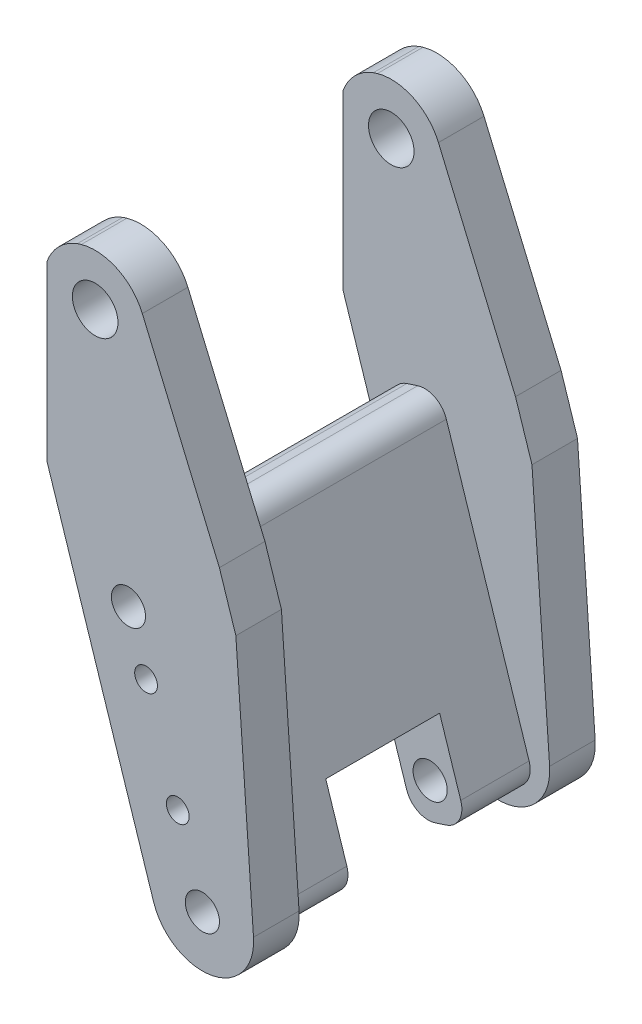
ISO-10303-21;
HEADER;
FILE_DESCRIPTION(('STEP AP214'),'2;1');
FILE_NAME('part.step','',(''),(''),'','','');
FILE_SCHEMA(('AUTOMOTIVE_DESIGN { 1 0 10303 214 1 1 1 1 }'));
ENDSEC;
DATA;
#1=APPLICATION_CONTEXT('core data for automotive mechanical design processes');
#2=APPLICATION_PROTOCOL_DEFINITION('international standard','automotive_design',2000,#1);
#3=PRODUCT_CONTEXT('',#1,'mechanical');
#4=PRODUCT('Part','Part','',(#3));
#5=PRODUCT_RELATED_PRODUCT_CATEGORY('part','',(#4));
#6=PRODUCT_DEFINITION_FORMATION('','',#4);
#7=PRODUCT_DEFINITION_CONTEXT('part definition',#1,'design');
#8=PRODUCT_DEFINITION('design','',#6,#7);
#9=PRODUCT_DEFINITION_SHAPE('','',#8);
#10=(LENGTH_UNIT() NAMED_UNIT(*) SI_UNIT(.MILLI.,.METRE.));
#11=(NAMED_UNIT(*) PLANE_ANGLE_UNIT() SI_UNIT($,.RADIAN.));
#12=(NAMED_UNIT(*) SI_UNIT($,.STERADIAN.) SOLID_ANGLE_UNIT());
#13=UNCERTAINTY_MEASURE_WITH_UNIT(LENGTH_MEASURE(1.E-05),#10,'distance_accuracy_value','');
#14=(GEOMETRIC_REPRESENTATION_CONTEXT(3) GLOBAL_UNCERTAINTY_ASSIGNED_CONTEXT((#13)) GLOBAL_UNIT_ASSIGNED_CONTEXT((#10,
#11,#12)) REPRESENTATION_CONTEXT('',''));
#15=CARTESIAN_POINT('',(0.,0.,0.));
#16=DIRECTION('',(0.,0.,1.));
#17=DIRECTION('',(1.,0.,0.));
#18=AXIS2_PLACEMENT_3D('',#15,#16,#17);
#19=CARTESIAN_POINT('',(20.6037080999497,-63.4116932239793,34.925));
#20=DIRECTION('',(0.,0.,1.));
#21=DIRECTION('',(1.,0.,0.));
#22=AXIS2_PLACEMENT_3D('',#19,#20,#21);
#23=PLANE('',#22);
#24=CARTESIAN_POINT('',(4.90564478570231,-15.0980221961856,34.925));
#25=DIRECTION('',(0.,0.,1.));
#26=DIRECTION('',(1.,0.,0.));
#27=AXIS2_PLACEMENT_3D('',#24,#25,#26);
#28=CIRCLE('',#27,3.175);
#29=CARTESIAN_POINT('',(8.08064478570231,-15.0980221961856,34.925));
#30=VERTEX_POINT('',#29);
#31=EDGE_CURVE('E280',#30,#30,#28,.F.);
#32=ORIENTED_EDGE('',*,*,#31,.T.);
#33=EDGE_LOOP('',(#32));
#34=FACE_BOUND('',#33,.T.);
#35=CARTESIAN_POINT('',(20.6037080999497,-63.4116932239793,34.925));
#36=DIRECTION('',(0.,0.,1.));
#37=DIRECTION('',(1.,0.,0.));
#38=AXIS2_PLACEMENT_3D('',#35,#36,#37);
#39=CIRCLE('',#38,4.7625);
#40=CARTESIAN_POINT('',(25.3662080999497,-63.4116932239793,34.925));
#41=VERTEX_POINT('',#40);
#42=EDGE_CURVE('E314',#41,#41,#39,.T.);
#43=ORIENTED_EDGE('',*,*,#42,.F.);
#44=EDGE_LOOP('',(#43));
#45=FACE_BOUND('',#44,.T.);
#46=CARTESIAN_POINT('',(0.,0.,34.925));
#47=DIRECTION('',(0.,0.,1.));
#48=DIRECTION('',(1.,0.,0.));
#49=AXIS2_PLACEMENT_3D('',#46,#47,#48);
#50=CIRCLE('',#49,4.7625);
#51=CARTESIAN_POINT('',(4.7625,0.,34.925));
#52=VERTEX_POINT('',#51);
#53=EDGE_CURVE('E329',#52,#52,#50,.T.);
#54=ORIENTED_EDGE('',*,*,#53,.F.);
#55=EDGE_LOOP('',(#54));
#56=FACE_BOUND('',#55,.T.);
#57=DIRECTION('',(-0.309016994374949,0.951056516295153,0.));
#58=VECTOR('',#57,1.);
#59=CARTESIAN_POINT('',(4.1111352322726,13.033516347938,34.925));
#60=LINE('',#59,#58);
#61=CARTESIAN_POINT('',(29.133848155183,-63.9784752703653,34.925));
#62=VERTEX_POINT('',#61);
#63=CARTESIAN_POINT('',(6.07339314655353,6.99430746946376,34.925));
#64=VERTEX_POINT('',#63);
#65=EDGE_CURVE('E335',#62,#64,#60,.T.);
#66=ORIENTED_EDGE('',*,*,#65,.T.);
#67=CARTESIAN_POINT('',(0.0341842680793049,5.03204955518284,34.925));
#68=DIRECTION('',(0.,0.,1.));
#69=DIRECTION('',(1.,0.,0.));
#70=AXIS2_PLACEMENT_3D('',#67,#68,#69);
#71=CIRCLE('',#70,6.35);
#72=CARTESIAN_POINT('',(-1.92807364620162,11.0712584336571,34.925));
#73=VERTEX_POINT('',#72);
#74=EDGE_CURVE('E380',#64,#73,#71,.T.);
#75=ORIENTED_EDGE('',*,*,#74,.T.);
#76=DIRECTION('',(-0.951056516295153,-0.309016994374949,0.));
#77=VECTOR('',#76,1.);
#78=CARTESIAN_POINT('',(-10.986886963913,8.12787156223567,34.925));
#79=LINE('',#78,#77);
#80=CARTESIAN_POINT('',(-4.94767808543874,10.0901294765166,34.925));
#81=VERTEX_POINT('',#80);
#82=EDGE_CURVE('E332',#73,#81,#79,.T.);
#83=ORIENTED_EDGE('',*,*,#82,.T.);
#84=CARTESIAN_POINT('',(-2.98542017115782,4.05092059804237,34.925));
#85=DIRECTION('',(0.,0.,1.));
#86=DIRECTION('',(1.,0.,0.));
#87=AXIS2_PLACEMENT_3D('',#84,#85,#86);
#88=CIRCLE('',#87,6.35);
#89=CARTESIAN_POINT('',(-9.02462904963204,2.08866268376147,34.925));
#90=VERTEX_POINT('',#89);
#91=EDGE_CURVE('E378',#81,#90,#88,.T.);
#92=ORIENTED_EDGE('',*,*,#91,.T.);
#93=DIRECTION('',(0.309016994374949,-0.951056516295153,0.));
#94=VECTOR('',#93,1.);
#95=CARTESIAN_POINT('',(15.9980838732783,-74.9233289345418,34.925));
#96=LINE('',#95,#94);
#97=CARTESIAN_POINT('',(14.0358259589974,-68.8841200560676,34.925));
#98=VERTEX_POINT('',#97);
#99=EDGE_CURVE('E341',#90,#98,#96,.T.);
#100=ORIENTED_EDGE('',*,*,#99,.T.);
#101=CARTESIAN_POINT('',(20.0750348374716,-66.9218621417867,34.925));
#102=DIRECTION('',(0.,0.,1.));
#103=DIRECTION('',(1.,0.,0.));
#104=AXIS2_PLACEMENT_3D('',#101,#102,#103);
#105=CIRCLE('',#104,6.35);
#106=CARTESIAN_POINT('',(22.0372927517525,-72.9610710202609,34.925));
#107=VERTEX_POINT('',#106);
#108=EDGE_CURVE('E376',#98,#107,#105,.T.);
#109=ORIENTED_EDGE('',*,*,#108,.T.);
#110=DIRECTION('',(0.951056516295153,0.309016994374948,0.));
#111=VECTOR('',#110,1.);
#112=CARTESIAN_POINT('',(31.0961060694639,-70.0176841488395,34.925));
#113=LINE('',#112,#111);
#114=CARTESIAN_POINT('',(25.0568971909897,-71.9799420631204,34.925));
#115=VERTEX_POINT('',#114);
#116=EDGE_CURVE('E338',#107,#115,#113,.T.);
#117=ORIENTED_EDGE('',*,*,#116,.T.);
#118=CARTESIAN_POINT('',(23.0946392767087,-65.9407331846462,34.925));
#119=DIRECTION('',(0.,0.,1.));
#120=DIRECTION('',(1.,0.,0.));
#121=AXIS2_PLACEMENT_3D('',#118,#119,#120);
#122=CIRCLE('',#121,6.35);
#123=EDGE_CURVE('E374',#115,#62,#122,.T.);
#124=ORIENTED_EDGE('',*,*,#123,.T.);
#125=EDGE_LOOP('',(#66,#75,#83,#92,#100,#109,#117,#124));
#126=FACE_BOUND('',#125,.T.);
#127=CARTESIAN_POINT('',(13.7358053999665,-42.2744621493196,34.925));
#128=DIRECTION('',(0.,0.,1.));
#129=DIRECTION('',(1.,0.,0.));
#130=AXIS2_PLACEMENT_3D('',#127,#128,#129);
#131=CIRCLE('',#130,3.175);
#132=CARTESIAN_POINT('',(16.9108053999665,-42.2744621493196,34.925));
#133=VERTEX_POINT('',#132);
#134=EDGE_CURVE('E289',#133,#133,#131,.F.);
#135=ORIENTED_EDGE('',*,*,#134,.T.);
#136=EDGE_LOOP('',(#135));
#137=FACE_BOUND('',#136,.T.);
#138=ADVANCED_FACE('F47',(#34,#45,#56,#126,#137),#23,.T.);
#139=CARTESIAN_POINT('',(31.0961060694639,-70.0176841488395,132.43082000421));
#140=DIRECTION('',(-0.309016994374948,0.951056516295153,0.));
#141=DIRECTION('',(-0.951056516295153,-0.309016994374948,0.));
#142=AXIS2_PLACEMENT_3D('',#139,#140,#141);
#143=PLANE('',#142);
#144=DIRECTION('',(-0.951056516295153,-0.309016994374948,0.));
#145=VECTOR('',#144,1.);
#146=CARTESIAN_POINT('',(31.0961060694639,-70.0176841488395,-34.925));
#147=LINE('',#146,#145);
#148=CARTESIAN_POINT('',(25.0568971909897,-71.9799420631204,-34.925));
#149=VERTEX_POINT('',#148);
#150=CARTESIAN_POINT('',(22.0372927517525,-72.9610710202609,-34.925));
#151=VERTEX_POINT('',#150);
#152=EDGE_CURVE('E316',#149,#151,#147,.T.);
#153=ORIENTED_EDGE('',*,*,#152,.F.);
#154=DIRECTION('',(0.,0.,-1.));
#155=VECTOR('',#154,1.);
#156=CARTESIAN_POINT('',(25.0568971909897,-71.9799420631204,132.43082000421));
#157=LINE('',#156,#155);
#158=CARTESIAN_POINT('',(25.0568971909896,-71.9799420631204,-15.875));
#159=VERTEX_POINT('',#158);
#160=EDGE_CURVE('E401',#149,#159,#157,.F.);
#161=ORIENTED_EDGE('',*,*,#160,.T.);
#162=DIRECTION('',(-0.951056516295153,-0.309016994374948,0.));
#163=VECTOR('',#162,1.);
#164=CARTESIAN_POINT('',(31.0961060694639,-70.0176841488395,-15.875));
#165=LINE('',#164,#163);
#166=CARTESIAN_POINT('',(22.0372927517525,-72.9610710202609,-15.875));
#167=VERTEX_POINT('',#166);
#168=EDGE_CURVE('E301',#159,#167,#165,.T.);
#169=ORIENTED_EDGE('',*,*,#168,.T.);
#170=DIRECTION('',(0.,0.,-1.));
#171=VECTOR('',#170,1.);
#172=CARTESIAN_POINT('',(22.0372927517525,-72.9610710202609,132.43082000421));
#173=LINE('',#172,#171);
#174=EDGE_CURVE('E398',#167,#151,#173,.T.);
#175=ORIENTED_EDGE('',*,*,#174,.T.);
#176=EDGE_LOOP('',(#153,#161,#169,#175));
#177=FACE_BOUND('',#176,.T.);
#178=ADVANCED_FACE('F453',(#177),#143,.F.);
#179=CARTESIAN_POINT('',(20.6037080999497,-63.4116932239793,132.43082000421));
#180=DIRECTION('',(0.,0.,-1.));
#181=DIRECTION('',(-1.,0.,0.));
#182=AXIS2_PLACEMENT_3D('',#179,#180,#181);
#183=CYLINDRICAL_SURFACE('',#182,4.7625);
#184=CARTESIAN_POINT('',(20.6037080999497,-63.4116932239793,-15.875));
#185=DIRECTION('',(0.,0.,-1.));
#186=DIRECTION('',(-1.,0.,0.));
#187=AXIS2_PLACEMENT_3D('',#184,#185,#186);
#188=CIRCLE('',#187,4.7625);
#189=CARTESIAN_POINT('',(15.8412080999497,-63.4116932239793,-15.875));
#190=VERTEX_POINT('',#189);
#191=EDGE_CURVE('E298',#190,#190,#188,.T.);
#192=ORIENTED_EDGE('',*,*,#191,.F.);
#193=EDGE_LOOP('',(#192));
#194=FACE_BOUND('',#193,.T.);
#195=CARTESIAN_POINT('',(20.6037080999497,-63.4116932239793,-34.925));
#196=DIRECTION('',(0.,0.,1.));
#197=DIRECTION('',(1.,0.,0.));
#198=AXIS2_PLACEMENT_3D('',#195,#196,#197);
#199=CIRCLE('',#198,4.7625);
#200=CARTESIAN_POINT('',(25.3662080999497,-63.4116932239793,-34.925));
#201=VERTEX_POINT('',#200);
#202=EDGE_CURVE('E315',#201,#201,#199,.F.);
#203=ORIENTED_EDGE('',*,*,#202,.T.);
#204=EDGE_LOOP('',(#203));
#205=FACE_BOUND('',#204,.T.);
#206=ADVANCED_FACE('F459',(#194,#205),#183,.F.);
#207=CARTESIAN_POINT('',(-10.986886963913,8.12787156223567,132.43082000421));
#208=DIRECTION('',(0.309016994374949,-0.951056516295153,0.));
#209=DIRECTION('',(0.951056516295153,0.309016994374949,0.));
#210=AXIS2_PLACEMENT_3D('',#207,#208,#209);
#211=PLANE('',#210);
#212=ORIENTED_EDGE('',*,*,#82,.F.);
#213=DIRECTION('',(0.,0.,-1.));
#214=VECTOR('',#213,1.);
#215=CARTESIAN_POINT('',(-1.92807364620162,11.0712584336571,132.43082000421));
#216=LINE('',#215,#214);
#217=CARTESIAN_POINT('',(-1.92807364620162,11.0712584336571,-34.925));
#218=VERTEX_POINT('',#217);
#219=EDGE_CURVE('E355',#73,#218,#216,.T.);
#220=ORIENTED_EDGE('',*,*,#219,.T.);
#221=DIRECTION('',(0.951056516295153,0.309016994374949,0.));
#222=VECTOR('',#221,1.);
#223=CARTESIAN_POINT('',(-10.986886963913,8.12787156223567,-34.925));
#224=LINE('',#223,#222);
#225=CARTESIAN_POINT('',(-4.94767808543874,10.0901294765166,-34.925));
#226=VERTEX_POINT('',#225);
#227=EDGE_CURVE('E322',#226,#218,#224,.T.);
#228=ORIENTED_EDGE('',*,*,#227,.F.);
#229=DIRECTION('',(0.,0.,-1.));
#230=VECTOR('',#229,1.);
#231=CARTESIAN_POINT('',(-4.94767808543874,10.0901294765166,132.43082000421));
#232=LINE('',#231,#230);
#233=EDGE_CURVE('E353',#226,#81,#232,.F.);
#234=ORIENTED_EDGE('',*,*,#233,.T.);
#235=EDGE_LOOP('',(#212,#220,#228,#234));
#236=FACE_BOUND('',#235,.T.);
#237=ADVANCED_FACE('F476',(#236),#211,.F.);
#238=CARTESIAN_POINT('',(4.1111352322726,13.033516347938,132.43082000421));
#239=DIRECTION('',(-0.951056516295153,-0.309016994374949,0.));
#240=DIRECTION('',(0.309016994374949,-0.951056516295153,0.));
#241=AXIS2_PLACEMENT_3D('',#238,#239,#240);
#242=PLANE('',#241);
#243=DIRECTION('',(0.309016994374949,-0.951056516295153,0.));
#244=VECTOR('',#243,1.);
#245=CARTESIAN_POINT('',(4.1111352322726,13.033516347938,-34.925));
#246=LINE('',#245,#244);
#247=CARTESIAN_POINT('',(6.07339314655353,6.99430746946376,-34.925));
#248=VERTEX_POINT('',#247);
#249=CARTESIAN_POINT('',(29.133848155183,-63.9784752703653,-34.925));
#250=VERTEX_POINT('',#249);
#251=EDGE_CURVE('E310',#248,#250,#246,.T.);
#252=ORIENTED_EDGE('',*,*,#251,.F.);
#253=DIRECTION('',(0.,0.,-1.));
#254=VECTOR('',#253,1.);
#255=CARTESIAN_POINT('',(6.07339314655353,6.99430746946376,132.43082000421));
#256=LINE('',#255,#254);
#257=EDGE_CURVE('E372',#248,#64,#256,.F.);
#258=ORIENTED_EDGE('',*,*,#257,.T.);
#259=ORIENTED_EDGE('',*,*,#65,.F.);
#260=DIRECTION('',(0.,0.,-1.));
#261=VECTOR('',#260,1.);
#262=CARTESIAN_POINT('',(29.133848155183,-63.9784752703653,132.43082000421));
#263=LINE('',#262,#261);
#264=CARTESIAN_POINT('',(29.1338481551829,-63.9784752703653,15.875));
#265=VERTEX_POINT('',#264);
#266=EDGE_CURVE('E369',#62,#265,#263,.T.);
#267=ORIENTED_EDGE('',*,*,#266,.T.);
#268=DIRECTION('',(-0.309016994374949,0.951056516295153,0.));
#269=VECTOR('',#268,1.);
#270=CARTESIAN_POINT('',(4.11113523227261,13.033516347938,15.875));
#271=LINE('',#270,#269);
#272=CARTESIAN_POINT('',(23.2470744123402,-45.8608486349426,15.875));
#273=VERTEX_POINT('',#272);
#274=EDGE_CURVE('E296',#265,#273,#271,.T.);
#275=ORIENTED_EDGE('',*,*,#274,.T.);
#276=DIRECTION('',(0.,0.,-1.));
#277=VECTOR('',#276,1.);
#278=CARTESIAN_POINT('',(23.2470744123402,-45.8608486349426,132.43082000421));
#279=LINE('',#278,#277);
#280=CARTESIAN_POINT('',(23.2470744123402,-45.8608486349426,-15.875));
#281=VERTEX_POINT('',#280);
#282=EDGE_CURVE('E307',#273,#281,#279,.T.);
#283=ORIENTED_EDGE('',*,*,#282,.T.);
#284=DIRECTION('',(0.309016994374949,-0.951056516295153,0.));
#285=VECTOR('',#284,1.);
#286=CARTESIAN_POINT('',(4.1111352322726,13.033516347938,-15.875));
#287=LINE('',#286,#285);
#288=CARTESIAN_POINT('',(29.1338481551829,-63.9784752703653,-15.875));
#289=VERTEX_POINT('',#288);
#290=EDGE_CURVE('E304',#281,#289,#287,.T.);
#291=ORIENTED_EDGE('',*,*,#290,.T.);
#292=DIRECTION('',(0.,0.,-1.));
#293=VECTOR('',#292,1.);
#294=CARTESIAN_POINT('',(29.133848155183,-63.9784752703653,132.43082000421));
#295=LINE('',#294,#293);
#296=EDGE_CURVE('E366',#289,#250,#295,.T.);
#297=ORIENTED_EDGE('',*,*,#296,.T.);
#298=EDGE_LOOP('',(#252,#258,#259,#267,#275,#283,#291,#297));
#299=FACE_BOUND('',#298,.T.);
#300=ADVANCED_FACE('F479',(#299),#242,.F.);
#301=ORIENTED_EDGE('',*,*,#116,.F.);
#302=DIRECTION('',(0.,0.,-1.));
#303=VECTOR('',#302,1.);
#304=CARTESIAN_POINT('',(22.0372927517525,-72.9610710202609,132.43082000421));
#305=LINE('',#304,#303);
#306=CARTESIAN_POINT('',(22.0372927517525,-72.9610710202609,15.875));
#307=VERTEX_POINT('',#306);
#308=EDGE_CURVE('E391',#107,#307,#305,.T.);
#309=ORIENTED_EDGE('',*,*,#308,.T.);
#310=DIRECTION('',(0.951056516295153,0.309016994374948,0.));
#311=VECTOR('',#310,1.);
#312=CARTESIAN_POINT('',(31.0961060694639,-70.0176841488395,15.875));
#313=LINE('',#312,#311);
#314=CARTESIAN_POINT('',(25.0568971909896,-71.9799420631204,15.875));
#315=VERTEX_POINT('',#314);
#316=EDGE_CURVE('E293',#307,#315,#313,.T.);
#317=ORIENTED_EDGE('',*,*,#316,.T.);
#318=DIRECTION('',(0.,0.,-1.));
#319=VECTOR('',#318,1.);
#320=CARTESIAN_POINT('',(25.0568971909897,-71.9799420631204,132.43082000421));
#321=LINE('',#320,#319);
#322=EDGE_CURVE('E389',#315,#115,#321,.F.);
#323=ORIENTED_EDGE('',*,*,#322,.T.);
#324=EDGE_LOOP('',(#301,#309,#317,#323));
#325=FACE_BOUND('',#324,.T.);
#326=ADVANCED_FACE('F462',(#325),#143,.F.);
#327=CARTESIAN_POINT('',(15.9980838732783,-74.9233289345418,132.43082000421));
#328=DIRECTION('',(0.951056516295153,0.309016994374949,0.));
#329=DIRECTION('',(-0.309016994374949,0.951056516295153,0.));
#330=AXIS2_PLACEMENT_3D('',#327,#328,#329);
#331=PLANE('',#330);
#332=DIRECTION('',(0.,0.,1.));
#333=VECTOR('',#332,1.);
#334=CARTESIAN_POINT('',(5.1978163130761,-41.6835232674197,15.875));
#335=LINE('',#334,#333);
#336=CARTESIAN_POINT('',(5.19781631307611,-41.6835232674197,-15.875));
#337=VERTEX_POINT('',#336);
#338=CARTESIAN_POINT('',(5.1978163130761,-41.6835232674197,15.875));
#339=VERTEX_POINT('',#338);
#340=EDGE_CURVE('E243',#337,#339,#335,.T.);
#341=ORIENTED_EDGE('',*,*,#340,.F.);
#342=CARTESIAN_POINT('',(3.23555839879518,-35.6443143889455,-15.875));
#343=DIRECTION('',(-0.951056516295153,-0.309016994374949,0.));
#344=DIRECTION('',(-0.309016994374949,0.951056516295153,0.));
#345=AXIS2_PLACEMENT_3D('',#342,#343,#344);
#346=CIRCLE('',#345,6.35);
#347=CARTESIAN_POINT('',(3.23555839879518,-35.6443143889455,-22.225));
#348=VERTEX_POINT('',#347);
#349=EDGE_CURVE('E62',#348,#337,#346,.T.);
#350=ORIENTED_EDGE('',*,*,#349,.F.);
#351=DIRECTION('',(0.309016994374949,-0.951056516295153,0.));
#352=VECTOR('',#351,1.);
#353=CARTESIAN_POINT('',(3.23555839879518,-35.6443143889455,-22.225));
#354=LINE('',#353,#352);
#355=CARTESIAN_POINT('',(-3.62449526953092,-14.5312401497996,-22.225));
#356=VERTEX_POINT('',#355);
#357=EDGE_CURVE('E223',#356,#348,#354,.T.);
#358=ORIENTED_EDGE('',*,*,#357,.F.);
#359=CARTESIAN_POINT('',(-3.62449526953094,-14.5312401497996,-15.875));
#360=DIRECTION('',(-0.951056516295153,-0.309016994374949,0.));
#361=DIRECTION('',(0.309016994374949,-0.951056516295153,0.));
#362=AXIS2_PLACEMENT_3D('',#359,#360,#361);
#363=CIRCLE('',#362,6.35);
#364=CARTESIAN_POINT('',(-5.58675318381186,-8.49203127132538,-15.875));
#365=VERTEX_POINT('',#364);
#366=EDGE_CURVE('E226',#365,#356,#363,.T.);
#367=ORIENTED_EDGE('',*,*,#366,.F.);
#368=DIRECTION('',(0.,0.,-1.));
#369=VECTOR('',#368,1.);
#370=CARTESIAN_POINT('',(-5.58675318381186,-8.49203127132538,-15.875));
#371=LINE('',#370,#369);
#372=CARTESIAN_POINT('',(-5.58675318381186,-8.49203127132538,15.875));
#373=VERTEX_POINT('',#372);
#374=EDGE_CURVE('E254',#373,#365,#371,.T.);
#375=ORIENTED_EDGE('',*,*,#374,.F.);
#376=CARTESIAN_POINT('',(-3.62449526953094,-14.5312401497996,15.875));
#377=DIRECTION('',(-0.951056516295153,-0.309016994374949,0.));
#378=DIRECTION('',(-0.309016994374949,0.951056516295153,0.));
#379=AXIS2_PLACEMENT_3D('',#376,#377,#378);
#380=CIRCLE('',#379,6.35);
#381=CARTESIAN_POINT('',(-3.62449526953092,-14.5312401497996,22.225));
#382=VERTEX_POINT('',#381);
#383=EDGE_CURVE('E251',#382,#373,#380,.T.);
#384=ORIENTED_EDGE('',*,*,#383,.F.);
#385=DIRECTION('',(-0.309016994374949,0.951056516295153,0.));
#386=VECTOR('',#385,1.);
#387=CARTESIAN_POINT('',(-3.62449526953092,-14.5312401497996,22.225));
#388=LINE('',#387,#386);
#389=CARTESIAN_POINT('',(3.23555839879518,-35.6443143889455,22.225));
#390=VERTEX_POINT('',#389);
#391=EDGE_CURVE('E248',#390,#382,#388,.T.);
#392=ORIENTED_EDGE('',*,*,#391,.F.);
#393=CARTESIAN_POINT('',(3.23555839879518,-35.6443143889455,15.875));
#394=DIRECTION('',(-0.951056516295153,-0.309016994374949,0.));
#395=DIRECTION('',(-0.309016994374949,0.951056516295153,0.));
#396=AXIS2_PLACEMENT_3D('',#393,#394,#395);
#397=CIRCLE('',#396,6.35);
#398=EDGE_CURVE('E245',#339,#390,#397,.T.);
#399=ORIENTED_EDGE('',*,*,#398,.F.);
#400=EDGE_LOOP('',(#341,#350,#358,#367,#375,#384,#392,#399));
#401=FACE_BOUND('',#400,.T.);
#402=ORIENTED_EDGE('',*,*,#99,.F.);
#403=DIRECTION('',(0.,0.,-1.));
#404=VECTOR('',#403,1.);
#405=CARTESIAN_POINT('',(-9.02462904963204,2.08866268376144,132.43082000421));
#406=LINE('',#405,#404);
#407=CARTESIAN_POINT('',(-9.02462904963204,2.08866268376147,-34.925));
#408=VERTEX_POINT('',#407);
#409=EDGE_CURVE('E386',#90,#408,#406,.T.);
#410=ORIENTED_EDGE('',*,*,#409,.T.);
#411=DIRECTION('',(-0.309016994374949,0.951056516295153,0.));
#412=VECTOR('',#411,1.);
#413=CARTESIAN_POINT('',(15.9980838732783,-74.9233289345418,-34.925));
#414=LINE('',#413,#412);
#415=CARTESIAN_POINT('',(14.0358259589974,-68.8841200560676,-34.925));
#416=VERTEX_POINT('',#415);
#417=EDGE_CURVE('E319',#416,#408,#414,.T.);
#418=ORIENTED_EDGE('',*,*,#417,.F.);
#419=DIRECTION('',(0.,0.,-1.));
#420=VECTOR('',#419,1.);
#421=CARTESIAN_POINT('',(14.0358259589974,-68.8841200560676,132.43082000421));
#422=LINE('',#421,#420);
#423=CARTESIAN_POINT('',(14.0358259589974,-68.8841200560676,-15.875));
#424=VERTEX_POINT('',#423);
#425=EDGE_CURVE('E382',#416,#424,#422,.F.);
#426=ORIENTED_EDGE('',*,*,#425,.T.);
#427=DIRECTION('',(-0.309016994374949,0.951056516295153,0.));
#428=VECTOR('',#427,1.);
#429=CARTESIAN_POINT('',(15.9980838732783,-74.9233289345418,-15.875));
#430=LINE('',#429,#428);
#431=CARTESIAN_POINT('',(8.14905221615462,-50.7664934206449,-15.875));
#432=VERTEX_POINT('',#431);
#433=EDGE_CURVE('E299',#424,#432,#430,.T.);
#434=ORIENTED_EDGE('',*,*,#433,.T.);
#435=DIRECTION('',(0.,0.,1.));
#436=VECTOR('',#435,1.);
#437=CARTESIAN_POINT('',(8.14905221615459,-50.7664934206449,132.43082000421));
#438=LINE('',#437,#436);
#439=CARTESIAN_POINT('',(8.14905221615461,-50.7664934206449,15.875));
#440=VERTEX_POINT('',#439);
#441=EDGE_CURVE('E344',#432,#440,#438,.T.);
#442=ORIENTED_EDGE('',*,*,#441,.T.);
#443=DIRECTION('',(0.309016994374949,-0.951056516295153,0.));
#444=VECTOR('',#443,1.);
#445=CARTESIAN_POINT('',(15.9980838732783,-74.9233289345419,15.875));
#446=LINE('',#445,#444);
#447=CARTESIAN_POINT('',(14.0358259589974,-68.8841200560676,15.875));
#448=VERTEX_POINT('',#447);
#449=EDGE_CURVE('E290',#440,#448,#446,.T.);
#450=ORIENTED_EDGE('',*,*,#449,.T.);
#451=DIRECTION('',(0.,0.,-1.));
#452=VECTOR('',#451,1.);
#453=CARTESIAN_POINT('',(14.0358259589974,-68.8841200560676,132.43082000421));
#454=LINE('',#453,#452);
#455=EDGE_CURVE('E384',#448,#98,#454,.F.);
#456=ORIENTED_EDGE('',*,*,#455,.T.);
#457=EDGE_LOOP('',(#402,#410,#418,#426,#434,#442,#450,#456));
#458=FACE_BOUND('',#457,.T.);
#459=ADVANCED_FACE('F429',(#401,#458),#331,.F.);
#460=CARTESIAN_POINT('',(0.,0.,132.43082000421));
#461=DIRECTION('',(0.,0.,-1.));
#462=DIRECTION('',(-1.,0.,0.));
#463=AXIS2_PLACEMENT_3D('',#460,#461,#462);
#464=CYLINDRICAL_SURFACE('',#463,4.7625);
#465=ORIENTED_EDGE('',*,*,#53,.T.);
#466=EDGE_LOOP('',(#465));
#467=FACE_BOUND('',#466,.T.);
#468=CARTESIAN_POINT('',(0.,0.,-34.925));
#469=DIRECTION('',(0.,0.,1.));
#470=DIRECTION('',(1.,0.,0.));
#471=AXIS2_PLACEMENT_3D('',#468,#469,#470);
#472=CIRCLE('',#471,4.7625);
#473=CARTESIAN_POINT('',(4.7625,0.,-34.925));
#474=VERTEX_POINT('',#473);
#475=EDGE_CURVE('E311',#474,#474,#472,.F.);
#476=ORIENTED_EDGE('',*,*,#475,.T.);
#477=EDGE_LOOP('',(#476));
#478=FACE_BOUND('',#477,.T.);
#479=ADVANCED_FACE('F471',(#467,#478),#464,.F.);
#480=CARTESIAN_POINT('',(20.6037080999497,-63.4116932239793,15.875));
#481=DIRECTION('',(0.,0.,1.));
#482=DIRECTION('',(0.,-1.,0.));
#483=AXIS2_PLACEMENT_3D('',#480,#481,#482);
#484=CIRCLE('',#483,4.7625);
#485=CARTESIAN_POINT('',(20.6037080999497,-68.1741932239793,15.875));
#486=VERTEX_POINT('',#485);
#487=EDGE_CURVE('E285',#486,#486,#484,.T.);
#488=ORIENTED_EDGE('',*,*,#487,.F.);
#489=EDGE_LOOP('',(#488));
#490=FACE_BOUND('',#489,.T.);
#491=ORIENTED_EDGE('',*,*,#42,.T.);
#492=EDGE_LOOP('',(#491));
#493=FACE_BOUND('',#492,.T.);
#494=ADVANCED_FACE('F468',(#490,#493),#183,.F.);
#495=CARTESIAN_POINT('',(20.6037080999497,-63.4116932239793,-34.925));
#496=DIRECTION('',(0.,0.,1.));
#497=DIRECTION('',(1.,0.,0.));
#498=AXIS2_PLACEMENT_3D('',#495,#496,#497);
#499=PLANE('',#498);
#500=CARTESIAN_POINT('',(13.7358053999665,-42.2744621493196,-34.925));
#501=DIRECTION('',(0.,0.,1.));
#502=DIRECTION('',(1.,0.,0.));
#503=AXIS2_PLACEMENT_3D('',#500,#501,#502);
#504=CIRCLE('',#503,3.175);
#505=CARTESIAN_POINT('',(16.9108053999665,-42.2744621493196,-34.925));
#506=VERTEX_POINT('',#505);
#507=EDGE_CURVE('E281',#506,#506,#504,.T.);
#508=ORIENTED_EDGE('',*,*,#507,.T.);
#509=EDGE_LOOP('',(#508));
#510=FACE_BOUND('',#509,.T.);
#511=CARTESIAN_POINT('',(4.90564478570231,-15.0980221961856,-34.925));
#512=DIRECTION('',(0.,0.,1.));
#513=DIRECTION('',(1.,0.,0.));
#514=AXIS2_PLACEMENT_3D('',#511,#512,#513);
#515=CIRCLE('',#514,3.175);
#516=CARTESIAN_POINT('',(8.08064478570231,-15.0980221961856,-34.925));
#517=VERTEX_POINT('',#516);
#518=EDGE_CURVE('E276',#517,#517,#515,.T.);
#519=ORIENTED_EDGE('',*,*,#518,.T.);
#520=EDGE_LOOP('',(#519));
#521=FACE_BOUND('',#520,.T.);
#522=ORIENTED_EDGE('',*,*,#227,.T.);
#523=CARTESIAN_POINT('',(0.0341842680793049,5.03204955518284,-34.925));
#524=DIRECTION('',(0.,0.,1.));
#525=DIRECTION('',(1.,0.,0.));
#526=AXIS2_PLACEMENT_3D('',#523,#524,#525);
#527=CIRCLE('',#526,6.35);
#528=EDGE_CURVE('E364',#218,#248,#527,.F.);
#529=ORIENTED_EDGE('',*,*,#528,.T.);
#530=ORIENTED_EDGE('',*,*,#251,.T.);
#531=CARTESIAN_POINT('',(23.0946392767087,-65.9407331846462,-34.925));
#532=DIRECTION('',(0.,0.,1.));
#533=DIRECTION('',(1.,0.,0.));
#534=AXIS2_PLACEMENT_3D('',#531,#532,#533);
#535=CIRCLE('',#534,6.35);
#536=EDGE_CURVE('E360',#250,#149,#535,.F.);
#537=ORIENTED_EDGE('',*,*,#536,.T.);
#538=ORIENTED_EDGE('',*,*,#152,.T.);
#539=CARTESIAN_POINT('',(20.0750348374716,-66.9218621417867,-34.925));
#540=DIRECTION('',(0.,0.,1.));
#541=DIRECTION('',(1.,0.,0.));
#542=AXIS2_PLACEMENT_3D('',#539,#540,#541);
#543=CIRCLE('',#542,6.35);
#544=EDGE_CURVE('E358',#151,#416,#543,.F.);
#545=ORIENTED_EDGE('',*,*,#544,.T.);
#546=ORIENTED_EDGE('',*,*,#417,.T.);
#547=CARTESIAN_POINT('',(-2.98542017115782,4.05092059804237,-34.925));
#548=DIRECTION('',(0.,0.,1.));
#549=DIRECTION('',(1.,0.,0.));
#550=AXIS2_PLACEMENT_3D('',#547,#548,#549);
#551=CIRCLE('',#550,6.35);
#552=EDGE_CURVE('E362',#408,#226,#551,.F.);
#553=ORIENTED_EDGE('',*,*,#552,.T.);
#554=EDGE_LOOP('',(#522,#529,#530,#537,#538,#545,#546,#553));
#555=FACE_BOUND('',#554,.T.);
#556=ORIENTED_EDGE('',*,*,#202,.F.);
#557=EDGE_LOOP('',(#556));
#558=FACE_BOUND('',#557,.T.);
#559=ORIENTED_EDGE('',*,*,#475,.F.);
#560=EDGE_LOOP('',(#559));
#561=FACE_BOUND('',#560,.T.);
#562=ADVANCED_FACE('F466',(#510,#521,#555,#558,#561),#499,.F.);
#563=CARTESIAN_POINT('',(32.3058877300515,-42.9174617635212,-15.875));
#564=DIRECTION('',(-0.309016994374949,0.951056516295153,0.));
#565=DIRECTION('',(-0.951056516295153,-0.309016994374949,0.));
#566=AXIS2_PLACEMENT_3D('',#563,#564,#565);
#567=PLANE('',#566);
#568=DIRECTION('',(-0.951056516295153,-0.309016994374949,0.));
#569=VECTOR('',#568,1.);
#570=CARTESIAN_POINT('',(32.3058877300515,-42.9174617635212,15.875));
#571=LINE('',#570,#569);
#572=EDGE_CURVE('E286',#273,#440,#571,.T.);
#573=ORIENTED_EDGE('',*,*,#572,.T.);
#574=ORIENTED_EDGE('',*,*,#441,.F.);
#575=DIRECTION('',(-0.951056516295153,-0.309016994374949,0.));
#576=VECTOR('',#575,1.);
#577=CARTESIAN_POINT('',(32.3058877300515,-42.9174617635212,-15.875));
#578=LINE('',#577,#576);
#579=EDGE_CURVE('E282',#281,#432,#578,.T.);
#580=ORIENTED_EDGE('',*,*,#579,.F.);
#581=ORIENTED_EDGE('',*,*,#282,.F.);
#582=EDGE_LOOP('',(#573,#574,#580,#581));
#583=FACE_BOUND('',#582,.T.);
#584=ADVANCED_FACE('F524',(#583),#567,.F.);
#585=CARTESIAN_POINT('',(48.0039510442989,-91.231132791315,-15.875));
#586=DIRECTION('',(0.,0.,-1.));
#587=DIRECTION('',(-1.,0.,0.));
#588=AXIS2_PLACEMENT_3D('',#585,#586,#587);
#589=PLANE('',#588);
#590=ORIENTED_EDGE('',*,*,#191,.T.);
#591=EDGE_LOOP('',(#590));
#592=FACE_BOUND('',#591,.T.);
#593=ORIENTED_EDGE('',*,*,#168,.F.);
#594=CARTESIAN_POINT('',(23.0946392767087,-65.9407331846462,-15.875));
#595=DIRECTION('',(0.,0.,-1.));
#596=DIRECTION('',(-1.,0.,0.));
#597=AXIS2_PLACEMENT_3D('',#594,#595,#596);
#598=CIRCLE('',#597,6.35);
#599=EDGE_CURVE('E405',#159,#289,#598,.F.);
#600=ORIENTED_EDGE('',*,*,#599,.T.);
#601=ORIENTED_EDGE('',*,*,#290,.F.);
#602=ORIENTED_EDGE('',*,*,#579,.T.);
#603=ORIENTED_EDGE('',*,*,#433,.F.);
#604=CARTESIAN_POINT('',(20.0750348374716,-66.9218621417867,-15.875));
#605=DIRECTION('',(0.,0.,-1.));
#606=DIRECTION('',(-1.,0.,0.));
#607=AXIS2_PLACEMENT_3D('',#604,#605,#606);
#608=CIRCLE('',#607,6.35);
#609=EDGE_CURVE('E403',#424,#167,#608,.F.);
#610=ORIENTED_EDGE('',*,*,#609,.T.);
#611=EDGE_LOOP('',(#593,#600,#601,#602,#603,#610));
#612=FACE_BOUND('',#611,.T.);
#613=ADVANCED_FACE('F517',(#592,#612),#589,.F.);
#614=CARTESIAN_POINT('',(32.3058877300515,-42.9174617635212,15.875));
#615=DIRECTION('',(0.,0.,1.));
#616=DIRECTION('',(0.,-1.,0.));
#617=AXIS2_PLACEMENT_3D('',#614,#615,#616);
#618=PLANE('',#617);
#619=ORIENTED_EDGE('',*,*,#487,.T.);
#620=EDGE_LOOP('',(#619));
#621=FACE_BOUND('',#620,.T.);
#622=ORIENTED_EDGE('',*,*,#316,.F.);
#623=CARTESIAN_POINT('',(20.0750348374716,-66.9218621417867,15.875));
#624=DIRECTION('',(0.,0.,1.));
#625=DIRECTION('',(0.,-1.,0.));
#626=AXIS2_PLACEMENT_3D('',#623,#624,#625);
#627=CIRCLE('',#626,6.35);
#628=EDGE_CURVE('E396',#307,#448,#627,.F.);
#629=ORIENTED_EDGE('',*,*,#628,.T.);
#630=ORIENTED_EDGE('',*,*,#449,.F.);
#631=ORIENTED_EDGE('',*,*,#572,.F.);
#632=ORIENTED_EDGE('',*,*,#274,.F.);
#633=CARTESIAN_POINT('',(23.0946392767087,-65.9407331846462,15.875));
#634=DIRECTION('',(0.,0.,1.));
#635=DIRECTION('',(0.,-1.,0.));
#636=AXIS2_PLACEMENT_3D('',#633,#634,#635);
#637=CIRCLE('',#636,6.35);
#638=EDGE_CURVE('E394',#265,#315,#637,.F.);
#639=ORIENTED_EDGE('',*,*,#638,.T.);
#640=EDGE_LOOP('',(#622,#629,#630,#631,#632,#639));
#641=FACE_BOUND('',#640,.T.);
#642=ADVANCED_FACE('F492',(#621,#641),#618,.F.);
#643=CARTESIAN_POINT('',(0.0341842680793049,5.03204955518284,132.43082000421));
#644=DIRECTION('',(0.,0.,-1.));
#645=DIRECTION('',(-1.,0.,0.));
#646=AXIS2_PLACEMENT_3D('',#643,#644,#645);
#647=CYLINDRICAL_SURFACE('',#646,6.35);
#648=ORIENTED_EDGE('',*,*,#74,.F.);
#649=ORIENTED_EDGE('',*,*,#257,.F.);
#650=ORIENTED_EDGE('',*,*,#528,.F.);
#651=ORIENTED_EDGE('',*,*,#219,.F.);
#652=EDGE_LOOP('',(#648,#649,#650,#651));
#653=FACE_BOUND('',#652,.T.);
#654=ADVANCED_FACE('F488',(#653),#647,.T.);
#655=CARTESIAN_POINT('',(-2.98542017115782,4.05092059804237,132.43082000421));
#656=DIRECTION('',(0.,0.,-1.));
#657=DIRECTION('',(-1.,0.,0.));
#658=AXIS2_PLACEMENT_3D('',#655,#656,#657);
#659=CYLINDRICAL_SURFACE('',#658,6.35);
#660=ORIENTED_EDGE('',*,*,#91,.F.);
#661=ORIENTED_EDGE('',*,*,#233,.F.);
#662=ORIENTED_EDGE('',*,*,#552,.F.);
#663=ORIENTED_EDGE('',*,*,#409,.F.);
#664=EDGE_LOOP('',(#660,#661,#662,#663));
#665=FACE_BOUND('',#664,.T.);
#666=ADVANCED_FACE('F491',(#665),#659,.T.);
#667=CARTESIAN_POINT('',(20.0750348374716,-66.9218621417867,132.43082000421));
#668=DIRECTION('',(0.,0.,-1.));
#669=DIRECTION('',(-1.,0.,0.));
#670=AXIS2_PLACEMENT_3D('',#667,#668,#669);
#671=CYLINDRICAL_SURFACE('',#670,6.35);
#672=ORIENTED_EDGE('',*,*,#108,.F.);
#673=ORIENTED_EDGE('',*,*,#455,.F.);
#674=ORIENTED_EDGE('',*,*,#628,.F.);
#675=ORIENTED_EDGE('',*,*,#308,.F.);
#676=EDGE_LOOP('',(#672,#673,#674,#675));
#677=FACE_BOUND('',#676,.T.);
#678=ADVANCED_FACE('F496',(#677),#671,.T.);
#679=CARTESIAN_POINT('',(23.0946392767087,-65.9407331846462,132.43082000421));
#680=DIRECTION('',(0.,0.,-1.));
#681=DIRECTION('',(-1.,0.,0.));
#682=AXIS2_PLACEMENT_3D('',#679,#680,#681);
#683=CYLINDRICAL_SURFACE('',#682,6.35);
#684=ORIENTED_EDGE('',*,*,#123,.F.);
#685=ORIENTED_EDGE('',*,*,#322,.F.);
#686=ORIENTED_EDGE('',*,*,#638,.F.);
#687=ORIENTED_EDGE('',*,*,#266,.F.);
#688=EDGE_LOOP('',(#684,#685,#686,#687));
#689=FACE_BOUND('',#688,.T.);
#690=ADVANCED_FACE('F500',(#689),#683,.T.);
#691=CARTESIAN_POINT('',(23.0946392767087,-65.9407331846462,132.43082000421));
#692=DIRECTION('',(0.,0.,-1.));
#693=DIRECTION('',(-1.,0.,0.));
#694=AXIS2_PLACEMENT_3D('',#691,#692,#693);
#695=CYLINDRICAL_SURFACE('',#694,6.35);
#696=ORIENTED_EDGE('',*,*,#599,.F.);
#697=ORIENTED_EDGE('',*,*,#160,.F.);
#698=ORIENTED_EDGE('',*,*,#536,.F.);
#699=ORIENTED_EDGE('',*,*,#296,.F.);
#700=EDGE_LOOP('',(#696,#697,#698,#699));
#701=FACE_BOUND('',#700,.T.);
#702=ADVANCED_FACE('F503',(#701),#695,.T.);
#703=CARTESIAN_POINT('',(20.0750348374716,-66.9218621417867,132.43082000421));
#704=DIRECTION('',(0.,0.,-1.));
#705=DIRECTION('',(-1.,0.,0.));
#706=AXIS2_PLACEMENT_3D('',#703,#704,#705);
#707=CYLINDRICAL_SURFACE('',#706,6.35);
#708=ORIENTED_EDGE('',*,*,#609,.F.);
#709=ORIENTED_EDGE('',*,*,#425,.F.);
#710=ORIENTED_EDGE('',*,*,#544,.F.);
#711=ORIENTED_EDGE('',*,*,#174,.F.);
#712=EDGE_LOOP('',(#708,#709,#710,#711));
#713=FACE_BOUND('',#712,.T.);
#714=ADVANCED_FACE('F49',(#713),#707,.T.);
#715=CARTESIAN_POINT('',(4.90564478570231,-15.0980221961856,63.5));
#716=DIRECTION('',(0.,0.,-1.));
#717=DIRECTION('',(-1.,0.,0.));
#718=AXIS2_PLACEMENT_3D('',#715,#716,#717);
#719=CYLINDRICAL_SURFACE('',#718,3.175);
#720=CARTESIAN_POINT('',(4.90564478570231,-15.0980221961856,22.225));
#721=DIRECTION('',(0.,0.,1.));
#722=DIRECTION('',(0.,-1.,0.));
#723=AXIS2_PLACEMENT_3D('',#720,#721,#722);
#724=CIRCLE('',#723,3.175);
#725=CARTESIAN_POINT('',(3.92451582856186,-12.0784177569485,22.225));
#726=VERTEX_POINT('',#725);
#727=EDGE_CURVE('E12',#726,#726,#724,.T.);
#728=ORIENTED_EDGE('',*,*,#727,.F.);
#729=EDGE_LOOP('',(#728));
#730=FACE_BOUND('',#729,.T.);
#731=ORIENTED_EDGE('',*,*,#31,.F.);
#732=EDGE_LOOP('',(#731));
#733=FACE_BOUND('',#732,.T.);
#734=ADVANCED_FACE('F510',(#730,#733),#719,.F.);
#735=CARTESIAN_POINT('',(13.7358053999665,-42.2744621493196,63.5));
#736=DIRECTION('',(0.,0.,-1.));
#737=DIRECTION('',(-1.,0.,0.));
#738=AXIS2_PLACEMENT_3D('',#735,#736,#737);
#739=CYLINDRICAL_SURFACE('',#738,3.175);
#740=ORIENTED_EDGE('',*,*,#134,.F.);
#741=EDGE_LOOP('',(#740));
#742=FACE_BOUND('',#741,.T.);
#743=CARTESIAN_POINT('',(13.7358053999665,-42.2744621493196,12.7));
#744=DIRECTION('',(0.,0.,1.));
#745=DIRECTION('',(1.,0.,0.));
#746=AXIS2_PLACEMENT_3D('',#743,#744,#745);
#747=CIRCLE('',#746,3.175);
#748=CARTESIAN_POINT('',(16.9108053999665,-42.2744621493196,12.7));
#749=VERTEX_POINT('',#748);
#750=EDGE_CURVE('E277',#749,#749,#747,.T.);
#751=ORIENTED_EDGE('',*,*,#750,.F.);
#752=EDGE_LOOP('',(#751));
#753=FACE_BOUND('',#752,.T.);
#754=ADVANCED_FACE('F579',(#742,#753),#739,.F.);
#755=CARTESIAN_POINT('',(13.7358053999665,-42.2744621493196,12.7));
#756=DIRECTION('',(0.,0.,1.));
#757=DIRECTION('',(1.,0.,0.));
#758=AXIS2_PLACEMENT_3D('',#755,#756,#757);
#759=PLANE('',#758);
#760=ORIENTED_EDGE('',*,*,#750,.T.);
#761=EDGE_LOOP('',(#760));
#762=FACE_BOUND('',#761,.T.);
#763=ADVANCED_FACE('F583',(#762),#759,.T.);
#764=CARTESIAN_POINT('',(4.90564478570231,-15.0980221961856,-63.5));
#765=DIRECTION('',(0.,0.,1.));
#766=DIRECTION('',(1.,0.,0.));
#767=AXIS2_PLACEMENT_3D('',#764,#765,#766);
#768=CYLINDRICAL_SURFACE('',#767,3.175);
#769=CARTESIAN_POINT('',(4.90564478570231,-15.0980221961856,-22.225));
#770=DIRECTION('',(0.,0.,-1.));
#771=DIRECTION('',(0.,1.,0.));
#772=AXIS2_PLACEMENT_3D('',#769,#770,#771);
#773=CIRCLE('',#772,3.175);
#774=CARTESIAN_POINT('',(3.92451582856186,-12.0784177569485,-22.225));
#775=VERTEX_POINT('',#774);
#776=EDGE_CURVE('E55',#775,#775,#773,.F.);
#777=ORIENTED_EDGE('',*,*,#776,.T.);
#778=EDGE_LOOP('',(#777));
#779=FACE_BOUND('',#778,.T.);
#780=ORIENTED_EDGE('',*,*,#518,.F.);
#781=EDGE_LOOP('',(#780));
#782=FACE_BOUND('',#781,.T.);
#783=ADVANCED_FACE('F417',(#779,#782),#768,.F.);
#784=CARTESIAN_POINT('',(13.7358053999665,-42.2744621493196,-63.5));
#785=DIRECTION('',(0.,0.,1.));
#786=DIRECTION('',(1.,0.,0.));
#787=AXIS2_PLACEMENT_3D('',#784,#785,#786);
#788=CYLINDRICAL_SURFACE('',#787,3.175);
#789=CARTESIAN_POINT('',(13.7358053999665,-42.2744621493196,-12.7));
#790=DIRECTION('',(0.,0.,1.));
#791=DIRECTION('',(1.,0.,0.));
#792=AXIS2_PLACEMENT_3D('',#789,#790,#791);
#793=CIRCLE('',#792,3.175);
#794=CARTESIAN_POINT('',(16.9108053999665,-42.2744621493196,-12.7));
#795=VERTEX_POINT('',#794);
#796=EDGE_CURVE('E261',#795,#795,#793,.T.);
#797=ORIENTED_EDGE('',*,*,#796,.T.);
#798=EDGE_LOOP('',(#797));
#799=FACE_BOUND('',#798,.T.);
#800=ORIENTED_EDGE('',*,*,#507,.F.);
#801=EDGE_LOOP('',(#800));
#802=FACE_BOUND('',#801,.T.);
#803=ADVANCED_FACE('F590',(#799,#802),#788,.F.);
#804=CARTESIAN_POINT('',(13.7358053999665,-42.2744621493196,-12.7));
#805=DIRECTION('',(0.,0.,1.));
#806=DIRECTION('',(1.,0.,0.));
#807=AXIS2_PLACEMENT_3D('',#804,#805,#806);
#808=PLANE('',#807);
#809=ORIENTED_EDGE('',*,*,#796,.F.);
#810=EDGE_LOOP('',(#809));
#811=FACE_BOUND('',#810,.T.);
#812=ADVANCED_FACE('F593',(#811),#808,.F.);
#813=CARTESIAN_POINT('',(15.3139761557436,-31.7197985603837,-22.225));
#814=DIRECTION('',(0.,0.,-1.));
#815=DIRECTION('',(0.,1.,0.));
#816=AXIS2_PLACEMENT_3D('',#813,#814,#815);
#817=PLANE('',#816);
#818=DIRECTION('',(-0.951056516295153,-0.309016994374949,0.));
#819=VECTOR('',#818,1.);
#820=CARTESIAN_POINT('',(8.45392248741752,-10.6067243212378,-22.225));
#821=LINE('',#820,#819);
#822=EDGE_CURVE('E264',#775,#356,#821,.T.);
#823=ORIENTED_EDGE('',*,*,#822,.T.);
#824=ORIENTED_EDGE('',*,*,#357,.T.);
#825=DIRECTION('',(-0.951056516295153,-0.309016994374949,0.));
#826=VECTOR('',#825,1.);
#827=CARTESIAN_POINT('',(15.3139761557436,-31.7197985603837,-22.225));
#828=LINE('',#827,#826);
#829=CARTESIAN_POINT('',(15.3139761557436,-31.7197985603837,-22.225));
#830=VERTEX_POINT('',#829);
#831=EDGE_CURVE('E259',#830,#348,#828,.T.);
#832=ORIENTED_EDGE('',*,*,#831,.F.);
#833=DIRECTION('',(0.309016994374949,-0.951056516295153,0.));
#834=VECTOR('',#833,1.);
#835=CARTESIAN_POINT('',(15.3139761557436,-31.7197985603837,-22.225));
#836=LINE('',#835,#834);
#837=CARTESIAN_POINT('',(8.45392248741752,-10.6067243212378,-22.225));
#838=VERTEX_POINT('',#837);
#839=EDGE_CURVE('E210',#838,#830,#836,.T.);
#840=ORIENTED_EDGE('',*,*,#839,.F.);
#841=EDGE_CURVE('E262',#838,#775,#821,.T.);
#842=ORIENTED_EDGE('',*,*,#841,.T.);
#843=ORIENTED_EDGE('',*,*,#776,.F.);
#844=EDGE_LOOP('',(#823,#824,#832,#840,#842,#843));
#845=FACE_BOUND('',#844,.T.);
#846=ADVANCED_FACE('F420',(#845),#817,.F.);
#847=CARTESIAN_POINT('',(15.3139761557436,-31.7197985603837,-15.875));
#848=DIRECTION('',(-0.951056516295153,-0.309016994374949,0.));
#849=DIRECTION('',(0.309016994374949,-0.951056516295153,0.));
#850=AXIS2_PLACEMENT_3D('',#847,#848,#849);
#851=CYLINDRICAL_SURFACE('',#850,6.35);
#852=ORIENTED_EDGE('',*,*,#349,.T.);
#853=DIRECTION('',(-0.951056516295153,-0.309016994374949,0.));
#854=VECTOR('',#853,1.);
#855=CARTESIAN_POINT('',(17.2762340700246,-37.7590074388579,-15.875));
#856=LINE('',#855,#854);
#857=CARTESIAN_POINT('',(17.2762340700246,-37.7590074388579,-15.875));
#858=VERTEX_POINT('',#857);
#859=EDGE_CURVE('E200',#858,#337,#856,.T.);
#860=ORIENTED_EDGE('',*,*,#859,.F.);
#861=CARTESIAN_POINT('',(15.3139761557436,-31.7197985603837,-15.875));
#862=DIRECTION('',(-0.951056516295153,-0.309016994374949,0.));
#863=DIRECTION('',(-0.309016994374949,0.951056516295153,0.));
#864=AXIS2_PLACEMENT_3D('',#861,#862,#863);
#865=CIRCLE('',#864,6.35);
#866=EDGE_CURVE('E204',#830,#858,#865,.T.);
#867=ORIENTED_EDGE('',*,*,#866,.F.);
#868=ORIENTED_EDGE('',*,*,#831,.T.);
#869=EDGE_LOOP('',(#852,#860,#867,#868));
#870=FACE_BOUND('',#869,.T.);
#871=ADVANCED_FACE('F202',(#870),#851,.F.);
#872=CARTESIAN_POINT('',(8.45392248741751,-10.6067243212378,-15.875));
#873=DIRECTION('',(-0.951056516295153,-0.309016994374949,0.));
#874=DIRECTION('',(0.309016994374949,-0.951056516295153,0.));
#875=AXIS2_PLACEMENT_3D('',#872,#873,#874);
#876=CYLINDRICAL_SURFACE('',#875,6.35);
#877=ORIENTED_EDGE('',*,*,#366,.T.);
#878=ORIENTED_EDGE('',*,*,#822,.F.);
#879=ORIENTED_EDGE('',*,*,#841,.F.);
#880=CARTESIAN_POINT('',(8.45392248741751,-10.6067243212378,-15.875));
#881=DIRECTION('',(-0.951056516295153,-0.309016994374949,0.));
#882=DIRECTION('',(0.309016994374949,-0.951056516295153,0.));
#883=AXIS2_PLACEMENT_3D('',#880,#881,#882);
#884=CIRCLE('',#883,6.35);
#885=CARTESIAN_POINT('',(6.49166457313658,-4.56751544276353,-15.875));
#886=VERTEX_POINT('',#885);
#887=EDGE_CURVE('E239',#886,#838,#884,.T.);
#888=ORIENTED_EDGE('',*,*,#887,.F.);
#889=DIRECTION('',(-0.951056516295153,-0.309016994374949,0.));
#890=VECTOR('',#889,1.);
#891=CARTESIAN_POINT('',(6.49166457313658,-4.56751544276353,-15.875));
#892=LINE('',#891,#890);
#893=EDGE_CURVE('E265',#886,#365,#892,.T.);
#894=ORIENTED_EDGE('',*,*,#893,.T.);
#895=EDGE_LOOP('',(#877,#878,#879,#888,#894));
#896=FACE_BOUND('',#895,.T.);
#897=ADVANCED_FACE('F424',(#896),#876,.F.);
#898=CARTESIAN_POINT('',(6.49166457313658,-4.56751544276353,-15.875));
#899=DIRECTION('',(-0.309016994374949,0.951056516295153,0.));
#900=DIRECTION('',(-0.951056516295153,-0.309016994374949,0.));
#901=AXIS2_PLACEMENT_3D('',#898,#899,#900);
#902=PLANE('',#901);
#903=ORIENTED_EDGE('',*,*,#374,.T.);
#904=ORIENTED_EDGE('',*,*,#893,.F.);
#905=DIRECTION('',(0.,0.,-1.));
#906=VECTOR('',#905,1.);
#907=CARTESIAN_POINT('',(6.49166457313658,-4.56751544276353,-15.875));
#908=LINE('',#907,#906);
#909=CARTESIAN_POINT('',(6.49166457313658,-4.56751544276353,15.875));
#910=VERTEX_POINT('',#909);
#911=EDGE_CURVE('E236',#910,#886,#908,.T.);
#912=ORIENTED_EDGE('',*,*,#911,.F.);
#913=DIRECTION('',(-0.951056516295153,-0.309016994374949,0.));
#914=VECTOR('',#913,1.);
#915=CARTESIAN_POINT('',(6.49166457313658,-4.56751544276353,15.875));
#916=LINE('',#915,#914);
#917=EDGE_CURVE('E267',#910,#373,#916,.T.);
#918=ORIENTED_EDGE('',*,*,#917,.T.);
#919=EDGE_LOOP('',(#903,#904,#912,#918));
#920=FACE_BOUND('',#919,.T.);
#921=ADVANCED_FACE('F443',(#920),#902,.F.);
#922=CARTESIAN_POINT('',(8.45392248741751,-10.6067243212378,15.875));
#923=DIRECTION('',(-0.951056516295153,-0.309016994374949,0.));
#924=DIRECTION('',(0.309016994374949,-0.951056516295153,0.));
#925=AXIS2_PLACEMENT_3D('',#922,#923,#924);
#926=CYLINDRICAL_SURFACE('',#925,6.35);
#927=ORIENTED_EDGE('',*,*,#383,.T.);
#928=ORIENTED_EDGE('',*,*,#917,.F.);
#929=CARTESIAN_POINT('',(8.45392248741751,-10.6067243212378,15.875));
#930=DIRECTION('',(-0.951056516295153,-0.309016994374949,0.));
#931=DIRECTION('',(-0.309016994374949,0.951056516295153,0.));
#932=AXIS2_PLACEMENT_3D('',#929,#930,#931);
#933=CIRCLE('',#932,6.35);
#934=CARTESIAN_POINT('',(8.45392248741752,-10.6067243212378,22.225));
#935=VERTEX_POINT('',#934);
#936=EDGE_CURVE('E233',#935,#910,#933,.T.);
#937=ORIENTED_EDGE('',*,*,#936,.F.);
#938=DIRECTION('',(-0.951056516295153,-0.309016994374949,0.));
#939=VECTOR('',#938,1.);
#940=CARTESIAN_POINT('',(8.45392248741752,-10.6067243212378,22.225));
#941=LINE('',#940,#939);
#942=EDGE_CURVE('E70',#935,#726,#941,.T.);
#943=ORIENTED_EDGE('',*,*,#942,.T.);
#944=EDGE_CURVE('E270',#726,#382,#941,.T.);
#945=ORIENTED_EDGE('',*,*,#944,.T.);
#946=EDGE_LOOP('',(#927,#928,#937,#943,#945));
#947=FACE_BOUND('',#946,.T.);
#948=ADVANCED_FACE('F440',(#947),#926,.F.);
#949=CARTESIAN_POINT('',(8.45392248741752,-10.6067243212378,22.225));
#950=DIRECTION('',(0.,0.,1.));
#951=DIRECTION('',(0.,-1.,0.));
#952=AXIS2_PLACEMENT_3D('',#949,#950,#951);
#953=PLANE('',#952);
#954=ORIENTED_EDGE('',*,*,#942,.F.);
#955=DIRECTION('',(-0.309016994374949,0.951056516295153,0.));
#956=VECTOR('',#955,1.);
#957=CARTESIAN_POINT('',(8.45392248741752,-10.6067243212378,22.225));
#958=LINE('',#957,#956);
#959=CARTESIAN_POINT('',(15.3139761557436,-31.7197985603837,22.225));
#960=VERTEX_POINT('',#959);
#961=EDGE_CURVE('E230',#960,#935,#958,.T.);
#962=ORIENTED_EDGE('',*,*,#961,.F.);
#963=DIRECTION('',(-0.951056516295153,-0.309016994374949,0.));
#964=VECTOR('',#963,1.);
#965=CARTESIAN_POINT('',(15.3139761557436,-31.7197985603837,22.225));
#966=LINE('',#965,#964);
#967=EDGE_CURVE('E271',#960,#390,#966,.T.);
#968=ORIENTED_EDGE('',*,*,#967,.T.);
#969=ORIENTED_EDGE('',*,*,#391,.T.);
#970=ORIENTED_EDGE('',*,*,#944,.F.);
#971=ORIENTED_EDGE('',*,*,#727,.T.);
#972=EDGE_LOOP('',(#954,#962,#968,#969,#970,#971));
#973=FACE_BOUND('',#972,.T.);
#974=ADVANCED_FACE('F438',(#973),#953,.F.);
#975=CARTESIAN_POINT('',(15.3139761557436,-31.7197985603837,15.875));
#976=DIRECTION('',(-0.951056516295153,-0.309016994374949,0.));
#977=DIRECTION('',(0.309016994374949,-0.951056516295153,0.));
#978=AXIS2_PLACEMENT_3D('',#975,#976,#977);
#979=CYLINDRICAL_SURFACE('',#978,6.35);
#980=ORIENTED_EDGE('',*,*,#398,.T.);
#981=ORIENTED_EDGE('',*,*,#967,.F.);
#982=CARTESIAN_POINT('',(15.3139761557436,-31.7197985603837,15.875));
#983=DIRECTION('',(-0.951056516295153,-0.309016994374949,0.));
#984=DIRECTION('',(-0.309016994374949,0.951056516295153,0.));
#985=AXIS2_PLACEMENT_3D('',#982,#983,#984);
#986=CIRCLE('',#985,6.35);
#987=CARTESIAN_POINT('',(17.2762340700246,-37.7590074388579,15.875));
#988=VERTEX_POINT('',#987);
#989=EDGE_CURVE('E218',#988,#960,#986,.T.);
#990=ORIENTED_EDGE('',*,*,#989,.F.);
#991=DIRECTION('',(-0.951056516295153,-0.309016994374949,0.));
#992=VECTOR('',#991,1.);
#993=CARTESIAN_POINT('',(17.2762340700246,-37.7590074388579,15.875));
#994=LINE('',#993,#992);
#995=EDGE_CURVE('E209',#988,#339,#994,.T.);
#996=ORIENTED_EDGE('',*,*,#995,.T.);
#997=EDGE_LOOP('',(#980,#981,#990,#996));
#998=FACE_BOUND('',#997,.T.);
#999=ADVANCED_FACE('F435',(#998),#979,.F.);
#1000=CARTESIAN_POINT('',(17.2762340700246,-37.7590074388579,15.875));
#1001=DIRECTION('',(0.309016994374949,-0.951056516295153,0.));
#1002=DIRECTION('',(0.951056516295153,0.309016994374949,0.));
#1003=AXIS2_PLACEMENT_3D('',#1000,#1001,#1002);
#1004=PLANE('',#1003);
#1005=ORIENTED_EDGE('',*,*,#340,.T.);
#1006=ORIENTED_EDGE('',*,*,#995,.F.);
#1007=DIRECTION('',(0.,0.,1.));
#1008=VECTOR('',#1007,1.);
#1009=CARTESIAN_POINT('',(17.2762340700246,-37.7590074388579,15.875));
#1010=LINE('',#1009,#1008);
#1011=EDGE_CURVE('E213',#858,#988,#1010,.T.);
#1012=ORIENTED_EDGE('',*,*,#1011,.F.);
#1013=ORIENTED_EDGE('',*,*,#859,.T.);
#1014=EDGE_LOOP('',(#1005,#1006,#1012,#1013));
#1015=FACE_BOUND('',#1014,.T.);
#1016=ADVANCED_FACE('F214',(#1015),#1004,.F.);
#1017=CARTESIAN_POINT('',(15.3139761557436,-31.7197985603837,-15.875));
#1018=DIRECTION('',(0.951056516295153,0.309016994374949,0.));
#1019=DIRECTION('',(-0.309016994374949,0.951056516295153,0.));
#1020=AXIS2_PLACEMENT_3D('',#1017,#1018,#1019);
#1021=PLANE('',#1020);
#1022=ORIENTED_EDGE('',*,*,#866,.T.);
#1023=ORIENTED_EDGE('',*,*,#1011,.T.);
#1024=ORIENTED_EDGE('',*,*,#989,.T.);
#1025=ORIENTED_EDGE('',*,*,#961,.T.);
#1026=ORIENTED_EDGE('',*,*,#936,.T.);
#1027=ORIENTED_EDGE('',*,*,#911,.T.);
#1028=ORIENTED_EDGE('',*,*,#887,.T.);
#1029=ORIENTED_EDGE('',*,*,#839,.T.);
#1030=EDGE_LOOP('',(#1022,#1023,#1024,#1025,#1026,#1027,#1028,#1029));
#1031=FACE_BOUND('',#1030,.T.);
#1032=ADVANCED_FACE('F220',(#1031),#1021,.F.);
#1033=CLOSED_SHELL('',(#138,#178,#206,#237,#300,#326,#459,#479,#494,#562,#584,#613,#642,#654,
#666,#678,#690,#702,#714,#734,#754,#763,#783,#803,#812,#846,#871,#897,#921,#948,#974,#999,#1016,#1032));
#1034=MANIFOLD_SOLID_BREP('B2',#1033);
#1035=CARTESIAN_POINT('',(-22.773630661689,71.8030601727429,-47.625));
#1036=DIRECTION('',(-1.,0.,0.));
#1037=DIRECTION('',(0.,0.,1.));
#1038=AXIS2_PLACEMENT_3D('',#1035,#1036,#1037);
#1039=PLANE('',#1038);
#1040=DIRECTION('',(0.,-1.,0.));
#1041=VECTOR('',#1040,1.);
#1042=CARTESIAN_POINT('',(-22.773630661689,71.8030601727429,-34.925));
#1043=LINE('',#1042,#1041);
#1044=CARTESIAN_POINT('',(-22.773630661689,71.8030601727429,-34.925));
#1045=VERTEX_POINT('',#1044);
#1046=CARTESIAN_POINT('',(-22.773630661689,23.8547069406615,-34.925));
#1047=VERTEX_POINT('',#1046);
#1048=EDGE_CURVE('E933',#1045,#1047,#1043,.T.);
#1049=ORIENTED_EDGE('',*,*,#1048,.F.);
#1050=DIRECTION('',(0.,0.,1.));
#1051=VECTOR('',#1050,1.);
#1052=CARTESIAN_POINT('',(-22.773630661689,71.8030601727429,-47.625));
#1053=LINE('',#1052,#1051);
#1054=CARTESIAN_POINT('',(-22.773630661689,71.8030601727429,-47.625));
#1055=VERTEX_POINT('',#1054);
#1056=EDGE_CURVE('E45',#1055,#1045,#1053,.T.);
#1057=ORIENTED_EDGE('',*,*,#1056,.F.);
#1058=DIRECTION('',(0.,-1.,0.));
#1059=VECTOR('',#1058,1.);
#1060=CARTESIAN_POINT('',(-22.773630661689,71.8030601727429,-47.625));
#1061=LINE('',#1060,#1059);
#1062=CARTESIAN_POINT('',(-22.773630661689,23.8547069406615,-47.625));
#1063=VERTEX_POINT('',#1062);
#1064=EDGE_CURVE('E957',#1055,#1063,#1061,.T.);
#1065=ORIENTED_EDGE('',*,*,#1064,.T.);
#1066=DIRECTION('',(0.,0.,1.));
#1067=VECTOR('',#1066,1.);
#1068=CARTESIAN_POINT('',(-22.773630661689,23.8547069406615,-47.625));
#1069=LINE('',#1068,#1067);
#1070=EDGE_CURVE('E888',#1063,#1047,#1069,.T.);
#1071=ORIENTED_EDGE('',*,*,#1070,.T.);
#1072=EDGE_LOOP('',(#1049,#1057,#1065,#1071));
#1073=FACE_BOUND('',#1072,.T.);
#1074=ADVANCED_FACE('F829',(#1073),#1039,.T.);
#1075=CARTESIAN_POINT('',(-9.28623066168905,67.0889645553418,-47.625));
#1076=DIRECTION('',(0.,0.,1.));
#1077=DIRECTION('',(1.,0.,0.));
#1078=AXIS2_PLACEMENT_3D('',#1075,#1076,#1077);
#1079=CYLINDRICAL_SURFACE('',#1078,14.2875);
#1080=CARTESIAN_POINT('',(-9.28623066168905,67.0889645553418,-34.925));
#1081=DIRECTION('',(0.,0.,1.));
#1082=DIRECTION('',(1.,0.,0.));
#1083=AXIS2_PLACEMENT_3D('',#1080,#1081,#1082);
#1084=CIRCLE('',#1083,14.2875);
#1085=CARTESIAN_POINT('',(-14.2701887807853,80.4789913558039,-34.925));
#1086=VERTEX_POINT('',#1085);
#1087=EDGE_CURVE('E955',#1086,#1045,#1084,.T.);
#1088=ORIENTED_EDGE('',*,*,#1087,.F.);
#1089=DIRECTION('',(0.,0.,1.));
#1090=VECTOR('',#1089,1.);
#1091=CARTESIAN_POINT('',(-14.2701887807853,80.4789913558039,-47.625));
#1092=LINE('',#1091,#1090);
#1093=CARTESIAN_POINT('',(-14.2701887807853,80.4789913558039,-47.625));
#1094=VERTEX_POINT('',#1093);
#1095=EDGE_CURVE('E838',#1094,#1086,#1092,.T.);
#1096=ORIENTED_EDGE('',*,*,#1095,.F.);
#1097=CARTESIAN_POINT('',(-9.28623066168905,67.0889645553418,-47.625));
#1098=DIRECTION('',(0.,0.,1.));
#1099=DIRECTION('',(1.,0.,0.));
#1100=AXIS2_PLACEMENT_3D('',#1097,#1098,#1099);
#1101=CIRCLE('',#1100,14.2875);
#1102=EDGE_CURVE('E923',#1094,#1055,#1101,.T.);
#1103=ORIENTED_EDGE('',*,*,#1102,.T.);
#1104=ORIENTED_EDGE('',*,*,#1056,.T.);
#1105=EDGE_LOOP('',(#1088,#1096,#1103,#1104));
#1106=FACE_BOUND('',#1105,.T.);
#1107=ADVANCED_FACE('F1025',(#1106),#1079,.T.);
#1108=CARTESIAN_POINT('',(-13.1245841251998,80.8512208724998,-47.625));
#1109=DIRECTION('',(-0.309016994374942,0.951056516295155,0.));
#1110=DIRECTION('',(-0.951056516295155,-0.309016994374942,0.));
#1111=AXIS2_PLACEMENT_3D('',#1108,#1109,#1110);
#1112=PLANE('',#1111);
#1113=DIRECTION('',(-0.951056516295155,-0.309016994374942,0.));
#1114=VECTOR('',#1113,1.);
#1115=CARTESIAN_POINT('',(-13.1245841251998,80.8512208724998,-34.925));
#1116=LINE('',#1115,#1114);
#1117=CARTESIAN_POINT('',(-13.1245841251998,80.8512208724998,-34.925));
#1118=VERTEX_POINT('',#1117);
#1119=EDGE_CURVE('E910',#1118,#1086,#1116,.T.);
#1120=ORIENTED_EDGE('',*,*,#1119,.F.);
#1121=DIRECTION('',(0.,0.,1.));
#1122=VECTOR('',#1121,1.);
#1123=CARTESIAN_POINT('',(-13.1245841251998,80.8512208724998,-47.625));
#1124=LINE('',#1123,#1122);
#1125=CARTESIAN_POINT('',(-13.1245841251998,80.8512208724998,-47.625));
#1126=VERTEX_POINT('',#1125);
#1127=EDGE_CURVE('E905',#1126,#1118,#1124,.T.);
#1128=ORIENTED_EDGE('',*,*,#1127,.F.);
#1129=DIRECTION('',(-0.951056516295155,-0.309016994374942,0.));
#1130=VECTOR('',#1129,1.);
#1131=CARTESIAN_POINT('',(-13.1245841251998,80.8512208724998,-47.625));
#1132=LINE('',#1131,#1130);
#1133=EDGE_CURVE('E908',#1126,#1094,#1132,.T.);
#1134=ORIENTED_EDGE('',*,*,#1133,.T.);
#1135=ORIENTED_EDGE('',*,*,#1095,.T.);
#1136=EDGE_LOOP('',(#1120,#1128,#1134,#1135));
#1137=FACE_BOUND('',#1136,.T.);
#1138=ADVANCED_FACE('F907',(#1137),#1112,.T.);
#1139=CARTESIAN_POINT('',(-9.28623066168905,67.0889645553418,-47.625));
#1140=DIRECTION('',(0.,0.,1.));
#1141=DIRECTION('',(1.,0.,0.));
#1142=AXIS2_PLACEMENT_3D('',#1139,#1140,#1141);
#1143=CYLINDRICAL_SURFACE('',#1142,14.2875);
#1144=CARTESIAN_POINT('',(-9.28623066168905,67.0889645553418,-34.925));
#1145=DIRECTION('',(0.,0.,1.));
#1146=DIRECTION('',(1.,0.,0.));
#1147=AXIS2_PLACEMENT_3D('',#1144,#1145,#1146);
#1148=CIRCLE('',#1147,14.2875);
#1149=CARTESIAN_POINT('',(3.86548243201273,72.6715355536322,-34.925));
#1150=VERTEX_POINT('',#1149);
#1151=EDGE_CURVE('E952',#1150,#1118,#1148,.T.);
#1152=ORIENTED_EDGE('',*,*,#1151,.F.);
#1153=DIRECTION('',(0.,0.,1.));
#1154=VECTOR('',#1153,1.);
#1155=CARTESIAN_POINT('',(3.86548243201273,72.6715355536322,-47.625));
#1156=LINE('',#1155,#1154);
#1157=CARTESIAN_POINT('',(3.86548243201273,72.6715355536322,-47.625));
#1158=VERTEX_POINT('',#1157);
#1159=EDGE_CURVE('E915',#1158,#1150,#1156,.T.);
#1160=ORIENTED_EDGE('',*,*,#1159,.F.);
#1161=CARTESIAN_POINT('',(-9.28623066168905,67.0889645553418,-47.625));
#1162=DIRECTION('',(0.,0.,1.));
#1163=DIRECTION('',(1.,0.,0.));
#1164=AXIS2_PLACEMENT_3D('',#1161,#1162,#1163);
#1165=CIRCLE('',#1164,14.2875);
#1166=EDGE_CURVE('E921',#1158,#1126,#1165,.T.);
#1167=ORIENTED_EDGE('',*,*,#1166,.T.);
#1168=ORIENTED_EDGE('',*,*,#1127,.T.);
#1169=EDGE_LOOP('',(#1152,#1160,#1167,#1168));
#1170=FACE_BOUND('',#1169,.T.);
#1171=ADVANCED_FACE('F925',(#1170),#1143,.T.);
#1172=CARTESIAN_POINT('',(3.86548243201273,72.6715355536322,-47.625));
#1173=DIRECTION('',(0.920504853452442,0.390731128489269,0.));
#1174=DIRECTION('',(-0.390731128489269,0.920504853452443,0.));
#1175=AXIS2_PLACEMENT_3D('',#1172,#1173,#1174);
#1176=PLANE('',#1175);
#1177=DIRECTION('',(-0.390731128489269,0.920504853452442,0.));
#1178=VECTOR('',#1177,1.);
#1179=CARTESIAN_POINT('',(3.86548243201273,72.6715355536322,-34.925));
#1180=LINE('',#1179,#1178);
#1181=CARTESIAN_POINT('',(25.3462906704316,22.065922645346,-34.925));
#1182=VERTEX_POINT('',#1181);
#1183=EDGE_CURVE('E949',#1182,#1150,#1180,.T.);
#1184=ORIENTED_EDGE('',*,*,#1183,.F.);
#1185=DIRECTION('',(0.,0.,1.));
#1186=VECTOR('',#1185,1.);
#1187=CARTESIAN_POINT('',(25.3462906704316,22.065922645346,-47.625));
#1188=LINE('',#1187,#1186);
#1189=CARTESIAN_POINT('',(25.3462906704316,22.065922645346,-47.625));
#1190=VERTEX_POINT('',#1189);
#1191=EDGE_CURVE('E961',#1190,#1182,#1188,.T.);
#1192=ORIENTED_EDGE('',*,*,#1191,.F.);
#1193=DIRECTION('',(-0.390731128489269,0.920504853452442,0.));
#1194=VECTOR('',#1193,1.);
#1195=CARTESIAN_POINT('',(3.86548243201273,72.6715355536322,-47.625));
#1196=LINE('',#1195,#1194);
#1197=EDGE_CURVE('E926',#1190,#1158,#1196,.T.);
#1198=ORIENTED_EDGE('',*,*,#1197,.T.);
#1199=ORIENTED_EDGE('',*,*,#1159,.T.);
#1200=EDGE_LOOP('',(#1184,#1192,#1198,#1199));
#1201=FACE_BOUND('',#1200,.T.);
#1202=ADVANCED_FACE('F1038',(#1201),#1176,.T.);
#1203=CARTESIAN_POINT('',(29.9368700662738,7.93757201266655,-47.625));
#1204=DIRECTION('',(0.951056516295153,0.309016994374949,0.));
#1205=DIRECTION('',(-0.309016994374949,0.951056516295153,0.));
#1206=AXIS2_PLACEMENT_3D('',#1203,#1204,#1205);
#1207=PLANE('',#1206);
#1208=DIRECTION('',(-0.309016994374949,0.951056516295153,0.));
#1209=VECTOR('',#1208,1.);
#1210=CARTESIAN_POINT('',(29.9368700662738,7.93757201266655,-34.925));
#1211=LINE('',#1210,#1209);
#1212=CARTESIAN_POINT('',(29.9368700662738,7.93757201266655,-34.925));
#1213=VERTEX_POINT('',#1212);
#1214=EDGE_CURVE('E946',#1213,#1182,#1211,.T.);
#1215=ORIENTED_EDGE('',*,*,#1214,.F.);
#1216=DIRECTION('',(0.,0.,1.));
#1217=VECTOR('',#1216,1.);
#1218=CARTESIAN_POINT('',(29.9368700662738,7.93757201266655,-47.625));
#1219=LINE('',#1218,#1217);
#1220=CARTESIAN_POINT('',(29.9368700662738,7.93757201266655,-47.625));
#1221=VERTEX_POINT('',#1220);
#1222=EDGE_CURVE('E963',#1221,#1213,#1219,.T.);
#1223=ORIENTED_EDGE('',*,*,#1222,.F.);
#1224=DIRECTION('',(-0.309016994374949,0.951056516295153,0.));
#1225=VECTOR('',#1224,1.);
#1226=CARTESIAN_POINT('',(29.9368700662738,7.93757201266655,-47.625));
#1227=LINE('',#1226,#1225);
#1228=EDGE_CURVE('E928',#1221,#1190,#1227,.T.);
#1229=ORIENTED_EDGE('',*,*,#1228,.T.);
#1230=ORIENTED_EDGE('',*,*,#1191,.T.);
#1231=EDGE_LOOP('',(#1215,#1223,#1229,#1230));
#1232=FACE_BOUND('',#1231,.T.);
#1233=ADVANCED_FACE('F1012',(#1232),#1207,.T.);
#1234=CARTESIAN_POINT('',(34.8564044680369,-62.4150476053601,-47.625));
#1235=DIRECTION('',(0.997564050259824,0.069756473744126,0.));
#1236=DIRECTION('',(-0.069756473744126,0.997564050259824,0.));
#1237=AXIS2_PLACEMENT_3D('',#1234,#1235,#1236);
#1238=PLANE('',#1237);
#1239=DIRECTION('',(-0.069756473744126,0.997564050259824,0.));
#1240=VECTOR('',#1239,1.);
#1241=CARTESIAN_POINT('',(34.8564044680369,-62.4150476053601,-34.925));
#1242=LINE('',#1241,#1240);
#1243=CARTESIAN_POINT('',(34.856404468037,-62.4150476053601,-34.925));
#1244=VERTEX_POINT('',#1243);
#1245=EDGE_CURVE('E943',#1244,#1213,#1242,.T.);
#1246=ORIENTED_EDGE('',*,*,#1245,.F.);
#1247=DIRECTION('',(0.,0.,1.));
#1248=VECTOR('',#1247,1.);
#1249=CARTESIAN_POINT('',(34.856404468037,-62.4150476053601,-47.625));
#1250=LINE('',#1249,#1248);
#1251=CARTESIAN_POINT('',(34.856404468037,-62.4150476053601,-47.625));
#1252=VERTEX_POINT('',#1251);
#1253=EDGE_CURVE('E965',#1252,#1244,#1250,.T.);
#1254=ORIENTED_EDGE('',*,*,#1253,.F.);
#1255=DIRECTION('',(-0.069756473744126,0.997564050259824,0.));
#1256=VECTOR('',#1255,1.);
#1257=CARTESIAN_POINT('',(34.8564044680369,-62.4150476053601,-47.625));
#1258=LINE('',#1257,#1256);
#1259=EDGE_CURVE('E1006',#1252,#1221,#1258,.T.);
#1260=ORIENTED_EDGE('',*,*,#1259,.T.);
#1261=ORIENTED_EDGE('',*,*,#1222,.T.);
#1262=EDGE_LOOP('',(#1246,#1254,#1260,#1261));
#1263=FACE_BOUND('',#1262,.T.);
#1264=ADVANCED_FACE('F1018',(#1263),#1238,.T.);
#1265=CARTESIAN_POINT('',(20.6037080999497,-63.4116932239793,-47.625));
#1266=DIRECTION('',(0.,0.,1.));
#1267=DIRECTION('',(1.,0.,0.));
#1268=AXIS2_PLACEMENT_3D('',#1265,#1266,#1267);
#1269=CYLINDRICAL_SURFACE('',#1268,14.2875);
#1270=CARTESIAN_POINT('',(20.6037080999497,-63.4116932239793,-34.925));
#1271=DIRECTION('',(0.,0.,1.));
#1272=DIRECTION('',(1.,0.,0.));
#1273=AXIS2_PLACEMENT_3D('',#1270,#1271,#1272);
#1274=CIRCLE('',#1273,14.2875);
#1275=CARTESIAN_POINT('',(7.01548812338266,-67.8267735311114,-34.925));
#1276=VERTEX_POINT('',#1275);
#1277=EDGE_CURVE('E940',#1276,#1244,#1274,.T.);
#1278=ORIENTED_EDGE('',*,*,#1277,.F.);
#1279=DIRECTION('',(0.,0.,1.));
#1280=VECTOR('',#1279,1.);
#1281=CARTESIAN_POINT('',(7.01548812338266,-67.8267735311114,-47.625));
#1282=LINE('',#1281,#1280);
#1283=CARTESIAN_POINT('',(7.01548812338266,-67.8267735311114,-47.625));
#1284=VERTEX_POINT('',#1283);
#1285=EDGE_CURVE('E967',#1284,#1276,#1282,.T.);
#1286=ORIENTED_EDGE('',*,*,#1285,.F.);
#1287=CARTESIAN_POINT('',(20.6037080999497,-63.4116932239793,-47.625));
#1288=DIRECTION('',(0.,0.,1.));
#1289=DIRECTION('',(1.,0.,0.));
#1290=AXIS2_PLACEMENT_3D('',#1287,#1288,#1289);
#1291=CIRCLE('',#1290,14.2875);
#1292=EDGE_CURVE('E1003',#1284,#1252,#1291,.T.);
#1293=ORIENTED_EDGE('',*,*,#1292,.T.);
#1294=ORIENTED_EDGE('',*,*,#1253,.T.);
#1295=EDGE_LOOP('',(#1278,#1286,#1293,#1294));
#1296=FACE_BOUND('',#1295,.T.);
#1297=ADVANCED_FACE('F1021',(#1296),#1269,.T.);
#1298=CARTESIAN_POINT('',(-22.773630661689,23.8547069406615,-47.625));
#1299=DIRECTION('',(-0.951056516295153,-0.309016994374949,0.));
#1300=DIRECTION('',(0.309016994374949,-0.951056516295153,0.));
#1301=AXIS2_PLACEMENT_3D('',#1298,#1299,#1300);
#1302=PLANE('',#1301);
#1303=DIRECTION('',(0.309016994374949,-0.951056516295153,0.));
#1304=VECTOR('',#1303,1.);
#1305=CARTESIAN_POINT('',(-22.773630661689,23.8547069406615,-34.925));
#1306=LINE('',#1305,#1304);
#1307=EDGE_CURVE('E936',#1047,#1276,#1306,.T.);
#1308=ORIENTED_EDGE('',*,*,#1307,.F.);
#1309=ORIENTED_EDGE('',*,*,#1070,.F.);
#1310=DIRECTION('',(0.309016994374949,-0.951056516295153,0.));
#1311=VECTOR('',#1310,1.);
#1312=CARTESIAN_POINT('',(-22.773630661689,23.8547069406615,-47.625));
#1313=LINE('',#1312,#1311);
#1314=EDGE_CURVE('E1001',#1063,#1284,#1313,.T.);
#1315=ORIENTED_EDGE('',*,*,#1314,.T.);
#1316=ORIENTED_EDGE('',*,*,#1285,.T.);
#1317=EDGE_LOOP('',(#1308,#1309,#1315,#1316));
#1318=FACE_BOUND('',#1317,.T.);
#1319=ADVANCED_FACE('F1022',(#1318),#1302,.T.);
#1320=CARTESIAN_POINT('',(20.6037080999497,-63.4116932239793,-47.625));
#1321=DIRECTION('',(0.,0.,1.));
#1322=DIRECTION('',(1.,0.,0.));
#1323=AXIS2_PLACEMENT_3D('',#1320,#1321,#1322);
#1324=PLANE('',#1323);
#1325=CARTESIAN_POINT('',(13.7358053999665,-42.2744621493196,-47.625));
#1326=DIRECTION('',(0.,0.,1.));
#1327=DIRECTION('',(1.,0.,0.));
#1328=AXIS2_PLACEMENT_3D('',#1325,#1326,#1327);
#1329=CIRCLE('',#1328,3.175);
#1330=CARTESIAN_POINT('',(16.9108053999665,-42.2744621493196,-47.625));
#1331=VERTEX_POINT('',#1330);
#1332=EDGE_CURVE('E979',#1331,#1331,#1329,.T.);
#1333=ORIENTED_EDGE('',*,*,#1332,.T.);
#1334=EDGE_LOOP('',(#1333));
#1335=FACE_BOUND('',#1334,.T.);
#1336=CARTESIAN_POINT('',(4.90564478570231,-15.0980221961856,-47.625));
#1337=DIRECTION('',(0.,0.,1.));
#1338=DIRECTION('',(1.,0.,0.));
#1339=AXIS2_PLACEMENT_3D('',#1336,#1337,#1338);
#1340=CIRCLE('',#1339,3.175);
#1341=CARTESIAN_POINT('',(8.08064478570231,-15.0980221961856,-47.625));
#1342=VERTEX_POINT('',#1341);
#1343=EDGE_CURVE('E971',#1342,#1342,#1340,.T.);
#1344=ORIENTED_EDGE('',*,*,#1343,.T.);
#1345=EDGE_LOOP('',(#1344));
#1346=FACE_BOUND('',#1345,.T.);
#1347=CARTESIAN_POINT('',(20.6037080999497,-63.4116932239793,-47.625));
#1348=DIRECTION('',(0.,0.,1.));
#1349=DIRECTION('',(1.,0.,0.));
#1350=AXIS2_PLACEMENT_3D('',#1347,#1348,#1349);
#1351=CIRCLE('',#1350,4.7625);
#1352=CARTESIAN_POINT('',(25.3662080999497,-63.4116932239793,-47.625));
#1353=VERTEX_POINT('',#1352);
#1354=EDGE_CURVE('E984',#1353,#1353,#1351,.T.);
#1355=ORIENTED_EDGE('',*,*,#1354,.T.);
#1356=EDGE_LOOP('',(#1355));
#1357=FACE_BOUND('',#1356,.T.);
#1358=CARTESIAN_POINT('',(0.,0.,-47.625));
#1359=DIRECTION('',(0.,0.,1.));
#1360=DIRECTION('',(1.,0.,0.));
#1361=AXIS2_PLACEMENT_3D('',#1358,#1359,#1360);
#1362=CIRCLE('',#1361,4.7625);
#1363=CARTESIAN_POINT('',(4.7625,0.,-47.625));
#1364=VERTEX_POINT('',#1363);
#1365=EDGE_CURVE('E990',#1364,#1364,#1362,.T.);
#1366=ORIENTED_EDGE('',*,*,#1365,.T.);
#1367=EDGE_LOOP('',(#1366));
#1368=FACE_BOUND('',#1367,.T.);
#1369=CARTESIAN_POINT('',(-9.28623066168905,67.0889645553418,-47.625));
#1370=DIRECTION('',(0.,0.,1.));
#1371=DIRECTION('',(1.,0.,0.));
#1372=AXIS2_PLACEMENT_3D('',#1369,#1370,#1371);
#1373=CIRCLE('',#1372,6.35);
#1374=CARTESIAN_POINT('',(-2.93623066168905,67.0889645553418,-47.625));
#1375=VERTEX_POINT('',#1374);
#1376=EDGE_CURVE('E937',#1375,#1375,#1373,.T.);
#1377=ORIENTED_EDGE('',*,*,#1376,.T.);
#1378=EDGE_LOOP('',(#1377));
#1379=FACE_BOUND('',#1378,.T.);
#1380=ORIENTED_EDGE('',*,*,#1064,.F.);
#1381=ORIENTED_EDGE('',*,*,#1102,.F.);
#1382=ORIENTED_EDGE('',*,*,#1133,.F.);
#1383=ORIENTED_EDGE('',*,*,#1166,.F.);
#1384=ORIENTED_EDGE('',*,*,#1197,.F.);
#1385=ORIENTED_EDGE('',*,*,#1228,.F.);
#1386=ORIENTED_EDGE('',*,*,#1259,.F.);
#1387=ORIENTED_EDGE('',*,*,#1292,.F.);
#1388=ORIENTED_EDGE('',*,*,#1314,.F.);
#1389=EDGE_LOOP('',(#1380,#1381,#1382,#1383,#1384,#1385,#1386,#1387,#1388));
#1390=FACE_BOUND('',#1389,.T.);
#1391=ADVANCED_FACE('F919',(#1335,#1346,#1357,#1368,#1379,#1390),#1324,.F.);
#1392=CARTESIAN_POINT('',(20.6037080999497,-63.4116932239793,-34.925));
#1393=DIRECTION('',(0.,0.,1.));
#1394=DIRECTION('',(1.,0.,0.));
#1395=AXIS2_PLACEMENT_3D('',#1392,#1393,#1394);
#1396=PLANE('',#1395);
#1397=CARTESIAN_POINT('',(13.7358053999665,-42.2744621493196,-34.925));
#1398=DIRECTION('',(0.,0.,1.));
#1399=DIRECTION('',(1.,0.,0.));
#1400=AXIS2_PLACEMENT_3D('',#1397,#1398,#1399);
#1401=CIRCLE('',#1400,3.175);
#1402=CARTESIAN_POINT('',(16.9108053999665,-42.2744621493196,-34.925));
#1403=VERTEX_POINT('',#1402);
#1404=EDGE_CURVE('E832',#1403,#1403,#1401,.T.);
#1405=ORIENTED_EDGE('',*,*,#1404,.F.);
#1406=EDGE_LOOP('',(#1405));
#1407=FACE_BOUND('',#1406,.T.);
#1408=CARTESIAN_POINT('',(4.90564478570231,-15.0980221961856,-34.925));
#1409=DIRECTION('',(0.,0.,1.));
#1410=DIRECTION('',(1.,0.,0.));
#1411=AXIS2_PLACEMENT_3D('',#1408,#1409,#1410);
#1412=CIRCLE('',#1411,3.175);
#1413=CARTESIAN_POINT('',(8.08064478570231,-15.0980221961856,-34.925));
#1414=VERTEX_POINT('',#1413);
#1415=EDGE_CURVE('E969',#1414,#1414,#1412,.T.);
#1416=ORIENTED_EDGE('',*,*,#1415,.F.);
#1417=EDGE_LOOP('',(#1416));
#1418=FACE_BOUND('',#1417,.T.);
#1419=CARTESIAN_POINT('',(20.6037080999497,-63.4116932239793,-34.925));
#1420=DIRECTION('',(0.,0.,1.));
#1421=DIRECTION('',(1.,0.,0.));
#1422=AXIS2_PLACEMENT_3D('',#1419,#1420,#1421);
#1423=CIRCLE('',#1422,4.7625);
#1424=CARTESIAN_POINT('',(25.3662080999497,-63.4116932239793,-34.925));
#1425=VERTEX_POINT('',#1424);
#1426=EDGE_CURVE('E983',#1425,#1425,#1423,.T.);
#1427=ORIENTED_EDGE('',*,*,#1426,.F.);
#1428=EDGE_LOOP('',(#1427));
#1429=FACE_BOUND('',#1428,.T.);
#1430=CARTESIAN_POINT('',(0.,0.,-34.925));
#1431=DIRECTION('',(0.,0.,1.));
#1432=DIRECTION('',(1.,0.,0.));
#1433=AXIS2_PLACEMENT_3D('',#1430,#1431,#1432);
#1434=CIRCLE('',#1433,4.7625);
#1435=CARTESIAN_POINT('',(4.7625,0.,-34.925));
#1436=VERTEX_POINT('',#1435);
#1437=EDGE_CURVE('E987',#1436,#1436,#1434,.T.);
#1438=ORIENTED_EDGE('',*,*,#1437,.F.);
#1439=EDGE_LOOP('',(#1438));
#1440=FACE_BOUND('',#1439,.T.);
#1441=CARTESIAN_POINT('',(-9.28623066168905,67.0889645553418,-34.925));
#1442=DIRECTION('',(0.,0.,1.));
#1443=DIRECTION('',(1.,0.,0.));
#1444=AXIS2_PLACEMENT_3D('',#1441,#1442,#1443);
#1445=CIRCLE('',#1444,6.35);
#1446=CARTESIAN_POINT('',(-2.93623066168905,67.0889645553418,-34.925));
#1447=VERTEX_POINT('',#1446);
#1448=EDGE_CURVE('E993',#1447,#1447,#1445,.T.);
#1449=ORIENTED_EDGE('',*,*,#1448,.F.);
#1450=EDGE_LOOP('',(#1449));
#1451=FACE_BOUND('',#1450,.T.);
#1452=ORIENTED_EDGE('',*,*,#1048,.T.);
#1453=ORIENTED_EDGE('',*,*,#1307,.T.);
#1454=ORIENTED_EDGE('',*,*,#1277,.T.);
#1455=ORIENTED_EDGE('',*,*,#1245,.T.);
#1456=ORIENTED_EDGE('',*,*,#1214,.T.);
#1457=ORIENTED_EDGE('',*,*,#1183,.T.);
#1458=ORIENTED_EDGE('',*,*,#1151,.T.);
#1459=ORIENTED_EDGE('',*,*,#1119,.T.);
#1460=ORIENTED_EDGE('',*,*,#1087,.T.);
#1461=EDGE_LOOP('',(#1452,#1453,#1454,#1455,#1456,#1457,#1458,#1459,#1460));
#1462=FACE_BOUND('',#1461,.T.);
#1463=ADVANCED_FACE('F1024',(#1407,#1418,#1429,#1440,#1451,#1462),#1396,.T.);
#1464=CARTESIAN_POINT('',(-9.28623066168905,67.0889645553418,-47.625));
#1465=DIRECTION('',(0.,0.,1.));
#1466=DIRECTION('',(1.,0.,0.));
#1467=AXIS2_PLACEMENT_3D('',#1464,#1465,#1466);
#1468=CYLINDRICAL_SURFACE('',#1467,6.35);
#1469=ORIENTED_EDGE('',*,*,#1376,.F.);
#1470=EDGE_LOOP('',(#1469));
#1471=FACE_BOUND('',#1470,.T.);
#1472=ORIENTED_EDGE('',*,*,#1448,.T.);
#1473=EDGE_LOOP('',(#1472));
#1474=FACE_BOUND('',#1473,.T.);
#1475=ADVANCED_FACE('F1055',(#1471,#1474),#1468,.F.);
#1476=CARTESIAN_POINT('',(0.,0.,-47.625));
#1477=DIRECTION('',(0.,0.,1.));
#1478=DIRECTION('',(1.,0.,0.));
#1479=AXIS2_PLACEMENT_3D('',#1476,#1477,#1478);
#1480=CYLINDRICAL_SURFACE('',#1479,4.7625);
#1481=ORIENTED_EDGE('',*,*,#1365,.F.);
#1482=EDGE_LOOP('',(#1481));
#1483=FACE_BOUND('',#1482,.T.);
#1484=ORIENTED_EDGE('',*,*,#1437,.T.);
#1485=EDGE_LOOP('',(#1484));
#1486=FACE_BOUND('',#1485,.T.);
#1487=ADVANCED_FACE('F1060',(#1483,#1486),#1480,.F.);
#1488=CARTESIAN_POINT('',(20.6037080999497,-63.4116932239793,-47.625));
#1489=DIRECTION('',(0.,0.,1.));
#1490=DIRECTION('',(1.,0.,0.));
#1491=AXIS2_PLACEMENT_3D('',#1488,#1489,#1490);
#1492=CYLINDRICAL_SURFACE('',#1491,4.7625);
#1493=ORIENTED_EDGE('',*,*,#1354,.F.);
#1494=EDGE_LOOP('',(#1493));
#1495=FACE_BOUND('',#1494,.T.);
#1496=ORIENTED_EDGE('',*,*,#1426,.T.);
#1497=EDGE_LOOP('',(#1496));
#1498=FACE_BOUND('',#1497,.T.);
#1499=ADVANCED_FACE('F1064',(#1495,#1498),#1492,.F.);
#1500=CARTESIAN_POINT('',(4.90564478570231,-15.0980221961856,-63.5));
#1501=DIRECTION('',(0.,0.,1.));
#1502=DIRECTION('',(1.,0.,0.));
#1503=AXIS2_PLACEMENT_3D('',#1500,#1501,#1502);
#1504=CYLINDRICAL_SURFACE('',#1503,3.175);
#1505=ORIENTED_EDGE('',*,*,#1415,.T.);
#1506=EDGE_LOOP('',(#1505));
#1507=FACE_BOUND('',#1506,.T.);
#1508=ORIENTED_EDGE('',*,*,#1343,.F.);
#1509=EDGE_LOOP('',(#1508));
#1510=FACE_BOUND('',#1509,.T.);
#1511=ADVANCED_FACE('F1068',(#1507,#1510),#1504,.F.);
#1512=CARTESIAN_POINT('',(13.7358053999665,-42.2744621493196,-63.5));
#1513=DIRECTION('',(0.,0.,1.));
#1514=DIRECTION('',(1.,0.,0.));
#1515=AXIS2_PLACEMENT_3D('',#1512,#1513,#1514);
#1516=CYLINDRICAL_SURFACE('',#1515,3.175);
#1517=ORIENTED_EDGE('',*,*,#1404,.T.);
#1518=EDGE_LOOP('',(#1517));
#1519=FACE_BOUND('',#1518,.T.);
#1520=ORIENTED_EDGE('',*,*,#1332,.F.);
#1521=EDGE_LOOP('',(#1520));
#1522=FACE_BOUND('',#1521,.T.);
#1523=ADVANCED_FACE('F1072',(#1519,#1522),#1516,.F.);
#1524=CLOSED_SHELL('',(#1074,#1107,#1138,#1171,#1202,#1233,#1264,#1297,#1319,#1391,#1463,#1475,
#1487,#1499,#1511,#1523));
#1525=MANIFOLD_SOLID_BREP('B6',#1524);
#1526=CARTESIAN_POINT('',(20.6037080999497,-63.4116932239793,47.625));
#1527=DIRECTION('',(0.,0.,1.));
#1528=DIRECTION('',(1.,0.,0.));
#1529=AXIS2_PLACEMENT_3D('',#1526,#1527,#1528);
#1530=PLANE('',#1529);
#1531=CARTESIAN_POINT('',(4.90564478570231,-15.0980221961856,47.625));
#1532=DIRECTION('',(0.,0.,1.));
#1533=DIRECTION('',(1.,0.,0.));
#1534=AXIS2_PLACEMENT_3D('',#1531,#1532,#1533);
#1535=CIRCLE('',#1534,3.175);
#1536=CARTESIAN_POINT('',(8.08064478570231,-15.0980221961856,47.625));
#1537=VERTEX_POINT('',#1536);
#1538=EDGE_CURVE('E1325',#1537,#1537,#1535,.F.);
#1539=ORIENTED_EDGE('',*,*,#1538,.T.);
#1540=EDGE_LOOP('',(#1539));
#1541=FACE_BOUND('',#1540,.T.);
#1542=CARTESIAN_POINT('',(-9.28623066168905,67.0889645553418,47.625));
#1543=DIRECTION('',(0.,0.,1.));
#1544=DIRECTION('',(1.,0.,0.));
#1545=AXIS2_PLACEMENT_3D('',#1542,#1543,#1544);
#1546=CIRCLE('',#1545,6.35);
#1547=CARTESIAN_POINT('',(-2.93623066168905,67.0889645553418,47.625));
#1548=VERTEX_POINT('',#1547);
#1549=EDGE_CURVE('E1344',#1548,#1548,#1546,.T.);
#1550=ORIENTED_EDGE('',*,*,#1549,.F.);
#1551=EDGE_LOOP('',(#1550));
#1552=FACE_BOUND('',#1551,.T.);
#1553=DIRECTION('',(0.309016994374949,-0.951056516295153,0.));
#1554=VECTOR('',#1553,1.);
#1555=CARTESIAN_POINT('',(-22.773630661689,23.8547069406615,47.625));
#1556=LINE('',#1555,#1554);
#1557=CARTESIAN_POINT('',(-22.773630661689,23.8547069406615,47.625));
#1558=VERTEX_POINT('',#1557);
#1559=CARTESIAN_POINT('',(7.01548812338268,-67.8267735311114,47.625));
#1560=VERTEX_POINT('',#1559);
#1561=EDGE_CURVE('E1309',#1558,#1560,#1556,.T.);
#1562=ORIENTED_EDGE('',*,*,#1561,.T.);
#1563=CARTESIAN_POINT('',(20.6037080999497,-63.4116932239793,47.625));
#1564=DIRECTION('',(0.,0.,1.));
#1565=DIRECTION('',(1.,0.,0.));
#1566=AXIS2_PLACEMENT_3D('',#1563,#1564,#1565);
#1567=CIRCLE('',#1566,14.2875);
#1568=CARTESIAN_POINT('',(34.8564044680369,-62.4150476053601,47.625));
#1569=VERTEX_POINT('',#1568);
#1570=EDGE_CURVE('E1252',#1560,#1569,#1567,.T.);
#1571=ORIENTED_EDGE('',*,*,#1570,.T.);
#1572=DIRECTION('',(-0.069756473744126,0.997564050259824,0.));
#1573=VECTOR('',#1572,1.);
#1574=CARTESIAN_POINT('',(34.8564044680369,-62.4150476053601,47.625));
#1575=LINE('',#1574,#1573);
#1576=CARTESIAN_POINT('',(29.9368700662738,7.93757201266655,47.625));
#1577=VERTEX_POINT('',#1576);
#1578=EDGE_CURVE('E1356',#1569,#1577,#1575,.T.);
#1579=ORIENTED_EDGE('',*,*,#1578,.T.);
#1580=DIRECTION('',(-0.309016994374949,0.951056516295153,0.));
#1581=VECTOR('',#1580,1.);
#1582=CARTESIAN_POINT('',(29.9368700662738,7.93757201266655,47.625));
#1583=LINE('',#1582,#1581);
#1584=CARTESIAN_POINT('',(25.3462906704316,22.065922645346,47.625));
#1585=VERTEX_POINT('',#1584);
#1586=EDGE_CURVE('E1358',#1577,#1585,#1583,.T.);
#1587=ORIENTED_EDGE('',*,*,#1586,.T.);
#1588=DIRECTION('',(-0.390731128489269,0.920504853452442,0.));
#1589=VECTOR('',#1588,1.);
#1590=CARTESIAN_POINT('',(3.86548243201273,72.6715355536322,47.625));
#1591=LINE('',#1590,#1589);
#1592=CARTESIAN_POINT('',(3.86548243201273,72.6715355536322,47.625));
#1593=VERTEX_POINT('',#1592);
#1594=EDGE_CURVE('E1360',#1585,#1593,#1591,.T.);
#1595=ORIENTED_EDGE('',*,*,#1594,.T.);
#1596=CARTESIAN_POINT('',(-9.28623066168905,67.0889645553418,47.625));
#1597=DIRECTION('',(0.,0.,1.));
#1598=DIRECTION('',(1.,0.,0.));
#1599=AXIS2_PLACEMENT_3D('',#1596,#1597,#1598);
#1600=CIRCLE('',#1599,14.2875);
#1601=CARTESIAN_POINT('',(-13.1245841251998,80.8512208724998,47.625));
#1602=VERTEX_POINT('',#1601);
#1603=EDGE_CURVE('E1274',#1593,#1602,#1600,.T.);
#1604=ORIENTED_EDGE('',*,*,#1603,.T.);
#1605=DIRECTION('',(-0.951056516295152,-0.309016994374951,0.));
#1606=VECTOR('',#1605,1.);
#1607=CARTESIAN_POINT('',(-13.1245841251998,80.8512208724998,47.625));
#1608=LINE('',#1607,#1606);
#1609=CARTESIAN_POINT('',(-14.2701887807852,80.478991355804,47.625));
#1610=VERTEX_POINT('',#1609);
#1611=EDGE_CURVE('E1268',#1602,#1610,#1608,.T.);
#1612=ORIENTED_EDGE('',*,*,#1611,.T.);
#1613=CARTESIAN_POINT('',(-9.28623066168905,67.0889645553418,47.625));
#1614=DIRECTION('',(0.,0.,1.));
#1615=DIRECTION('',(1.,0.,0.));
#1616=AXIS2_PLACEMENT_3D('',#1613,#1614,#1615);
#1617=CIRCLE('',#1616,14.2875);
#1618=CARTESIAN_POINT('',(-22.773630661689,71.8030601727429,47.625));
#1619=VERTEX_POINT('',#1618);
#1620=EDGE_CURVE('E1272',#1610,#1619,#1617,.T.);
#1621=ORIENTED_EDGE('',*,*,#1620,.T.);
#1622=DIRECTION('',(0.,-1.,0.));
#1623=VECTOR('',#1622,1.);
#1624=CARTESIAN_POINT('',(-22.773630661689,71.8030601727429,47.625));
#1625=LINE('',#1624,#1623);
#1626=EDGE_CURVE('E1206',#1619,#1558,#1625,.T.);
#1627=ORIENTED_EDGE('',*,*,#1626,.T.);
#1628=EDGE_LOOP('',(#1562,#1571,#1579,#1587,#1595,#1604,#1612,#1621,#1627));
#1629=FACE_BOUND('',#1628,.T.);
#1630=CARTESIAN_POINT('',(0.,0.,47.625));
#1631=DIRECTION('',(0.,0.,1.));
#1632=DIRECTION('',(1.,0.,0.));
#1633=AXIS2_PLACEMENT_3D('',#1630,#1631,#1632);
#1634=CIRCLE('',#1633,4.7625);
#1635=CARTESIAN_POINT('',(4.7625,0.,47.625));
#1636=VERTEX_POINT('',#1635);
#1637=EDGE_CURVE('E1296',#1636,#1636,#1634,.T.);
#1638=ORIENTED_EDGE('',*,*,#1637,.F.);
#1639=EDGE_LOOP('',(#1638));
#1640=FACE_BOUND('',#1639,.T.);
#1641=CARTESIAN_POINT('',(20.6037080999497,-63.4116932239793,47.625));
#1642=DIRECTION('',(0.,0.,1.));
#1643=DIRECTION('',(1.,0.,0.));
#1644=AXIS2_PLACEMENT_3D('',#1641,#1642,#1643);
#1645=CIRCLE('',#1644,4.7625);
#1646=CARTESIAN_POINT('',(25.3662080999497,-63.4116932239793,47.625));
#1647=VERTEX_POINT('',#1646);
#1648=EDGE_CURVE('E1338',#1647,#1647,#1645,.T.);
#1649=ORIENTED_EDGE('',*,*,#1648,.F.);
#1650=EDGE_LOOP('',(#1649));
#1651=FACE_BOUND('',#1650,.T.);
#1652=CARTESIAN_POINT('',(13.7358053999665,-42.2744621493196,47.625));
#1653=DIRECTION('',(0.,0.,1.));
#1654=DIRECTION('',(1.,0.,0.));
#1655=AXIS2_PLACEMENT_3D('',#1652,#1653,#1654);
#1656=CIRCLE('',#1655,3.175);
#1657=CARTESIAN_POINT('',(16.9108053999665,-42.2744621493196,47.625));
#1658=VERTEX_POINT('',#1657);
#1659=EDGE_CURVE('E1333',#1658,#1658,#1656,.F.);
#1660=ORIENTED_EDGE('',*,*,#1659,.T.);
#1661=EDGE_LOOP('',(#1660));
#1662=FACE_BOUND('',#1661,.T.);
#1663=ADVANCED_FACE('F1187',(#1541,#1552,#1629,#1640,#1651,#1662),#1530,.T.);
#1664=CARTESIAN_POINT('',(20.6037080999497,-63.4116932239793,34.925));
#1665=DIRECTION('',(0.,0.,1.));
#1666=DIRECTION('',(1.,0.,0.));
#1667=AXIS2_PLACEMENT_3D('',#1664,#1665,#1666);
#1668=PLANE('',#1667);
#1669=CARTESIAN_POINT('',(4.90564478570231,-15.0980221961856,34.925));
#1670=DIRECTION('',(0.,0.,1.));
#1671=DIRECTION('',(1.,0.,0.));
#1672=AXIS2_PLACEMENT_3D('',#1669,#1670,#1671);
#1673=CIRCLE('',#1672,3.175);
#1674=CARTESIAN_POINT('',(8.08064478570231,-15.0980221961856,34.925));
#1675=VERTEX_POINT('',#1674);
#1676=EDGE_CURVE('E1323',#1675,#1675,#1673,.F.);
#1677=ORIENTED_EDGE('',*,*,#1676,.F.);
#1678=EDGE_LOOP('',(#1677));
#1679=FACE_BOUND('',#1678,.T.);
#1680=CARTESIAN_POINT('',(-9.28623066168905,67.0889645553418,34.925));
#1681=DIRECTION('',(0.,0.,1.));
#1682=DIRECTION('',(1.,0.,0.));
#1683=AXIS2_PLACEMENT_3D('',#1680,#1681,#1682);
#1684=CIRCLE('',#1683,6.35);
#1685=CARTESIAN_POINT('',(-2.93623066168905,67.0889645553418,34.925));
#1686=VERTEX_POINT('',#1685);
#1687=EDGE_CURVE('E1341',#1686,#1686,#1684,.T.);
#1688=ORIENTED_EDGE('',*,*,#1687,.T.);
#1689=EDGE_LOOP('',(#1688));
#1690=FACE_BOUND('',#1689,.T.);
#1691=DIRECTION('',(0.309016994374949,-0.951056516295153,0.));
#1692=VECTOR('',#1691,1.);
#1693=CARTESIAN_POINT('',(-22.773630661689,23.8547069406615,34.925));
#1694=LINE('',#1693,#1692);
#1695=CARTESIAN_POINT('',(-22.773630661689,23.8547069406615,34.925));
#1696=VERTEX_POINT('',#1695);
#1697=CARTESIAN_POINT('',(7.01548812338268,-67.8267735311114,34.925));
#1698=VERTEX_POINT('',#1697);
#1699=EDGE_CURVE('E1292',#1696,#1698,#1694,.T.);
#1700=ORIENTED_EDGE('',*,*,#1699,.F.);
#1701=DIRECTION('',(0.,-1.,0.));
#1702=VECTOR('',#1701,1.);
#1703=CARTESIAN_POINT('',(-22.773630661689,71.8030601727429,34.925));
#1704=LINE('',#1703,#1702);
#1705=CARTESIAN_POINT('',(-22.773630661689,71.8030601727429,34.925));
#1706=VERTEX_POINT('',#1705);
#1707=EDGE_CURVE('E1244',#1706,#1696,#1704,.T.);
#1708=ORIENTED_EDGE('',*,*,#1707,.F.);
#1709=CARTESIAN_POINT('',(-9.28623066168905,67.0889645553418,34.925));
#1710=DIRECTION('',(0.,0.,1.));
#1711=DIRECTION('',(1.,0.,0.));
#1712=AXIS2_PLACEMENT_3D('',#1709,#1710,#1711);
#1713=CIRCLE('',#1712,14.2875);
#1714=CARTESIAN_POINT('',(-14.2701887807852,80.478991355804,34.925));
#1715=VERTEX_POINT('',#1714);
#1716=EDGE_CURVE('E1238',#1715,#1706,#1713,.T.);
#1717=ORIENTED_EDGE('',*,*,#1716,.F.);
#1718=DIRECTION('',(-0.951056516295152,-0.309016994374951,0.));
#1719=VECTOR('',#1718,1.);
#1720=CARTESIAN_POINT('',(-13.1245841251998,80.8512208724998,34.925));
#1721=LINE('',#1720,#1719);
#1722=CARTESIAN_POINT('',(-13.1245841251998,80.8512208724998,34.925));
#1723=VERTEX_POINT('',#1722);
#1724=EDGE_CURVE('E1282',#1723,#1715,#1721,.T.);
#1725=ORIENTED_EDGE('',*,*,#1724,.F.);
#1726=CARTESIAN_POINT('',(-9.28623066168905,67.0889645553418,34.925));
#1727=DIRECTION('',(0.,0.,1.));
#1728=DIRECTION('',(1.,0.,0.));
#1729=AXIS2_PLACEMENT_3D('',#1726,#1727,#1728);
#1730=CIRCLE('',#1729,14.2875);
#1731=CARTESIAN_POINT('',(3.86548243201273,72.6715355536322,34.925));
#1732=VERTEX_POINT('',#1731);
#1733=EDGE_CURVE('E1304',#1732,#1723,#1730,.T.);
#1734=ORIENTED_EDGE('',*,*,#1733,.F.);
#1735=DIRECTION('',(-0.390731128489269,0.920504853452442,0.));
#1736=VECTOR('',#1735,1.);
#1737=CARTESIAN_POINT('',(3.86548243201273,72.6715355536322,34.925));
#1738=LINE('',#1737,#1736);
#1739=CARTESIAN_POINT('',(25.3462906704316,22.065922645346,34.925));
#1740=VERTEX_POINT('',#1739);
#1741=EDGE_CURVE('E1302',#1740,#1732,#1738,.T.);
#1742=ORIENTED_EDGE('',*,*,#1741,.F.);
#1743=DIRECTION('',(-0.309016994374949,0.951056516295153,0.));
#1744=VECTOR('',#1743,1.);
#1745=CARTESIAN_POINT('',(29.9368700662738,7.93757201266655,34.925));
#1746=LINE('',#1745,#1744);
#1747=CARTESIAN_POINT('',(29.9368700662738,7.93757201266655,34.925));
#1748=VERTEX_POINT('',#1747);
#1749=EDGE_CURVE('E1300',#1748,#1740,#1746,.T.);
#1750=ORIENTED_EDGE('',*,*,#1749,.F.);
#1751=DIRECTION('',(-0.069756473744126,0.997564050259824,0.));
#1752=VECTOR('',#1751,1.);
#1753=CARTESIAN_POINT('',(34.8564044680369,-62.4150476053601,34.925));
#1754=LINE('',#1753,#1752);
#1755=CARTESIAN_POINT('',(34.8564044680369,-62.4150476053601,34.925));
#1756=VERTEX_POINT('',#1755);
#1757=EDGE_CURVE('E1298',#1756,#1748,#1754,.T.);
#1758=ORIENTED_EDGE('',*,*,#1757,.F.);
#1759=CARTESIAN_POINT('',(20.6037080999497,-63.4116932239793,34.925));
#1760=DIRECTION('',(0.,0.,1.));
#1761=DIRECTION('',(1.,0.,0.));
#1762=AXIS2_PLACEMENT_3D('',#1759,#1760,#1761);
#1763=CIRCLE('',#1762,14.2875);
#1764=EDGE_CURVE('E1295',#1698,#1756,#1763,.T.);
#1765=ORIENTED_EDGE('',*,*,#1764,.F.);
#1766=EDGE_LOOP('',(#1700,#1708,#1717,#1725,#1734,#1742,#1750,#1758,#1765));
#1767=FACE_BOUND('',#1766,.T.);
#1768=CARTESIAN_POINT('',(0.,0.,34.925));
#1769=DIRECTION('',(0.,0.,1.));
#1770=DIRECTION('',(1.,0.,0.));
#1771=AXIS2_PLACEMENT_3D('',#1768,#1769,#1770);
#1772=CIRCLE('',#1771,4.7625);
#1773=CARTESIAN_POINT('',(4.7625,0.,34.925));
#1774=VERTEX_POINT('',#1773);
#1775=EDGE_CURVE('E1347',#1774,#1774,#1772,.T.);
#1776=ORIENTED_EDGE('',*,*,#1775,.T.);
#1777=EDGE_LOOP('',(#1776));
#1778=FACE_BOUND('',#1777,.T.);
#1779=CARTESIAN_POINT('',(20.6037080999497,-63.4116932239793,34.925));
#1780=DIRECTION('',(0.,0.,1.));
#1781=DIRECTION('',(1.,0.,0.));
#1782=AXIS2_PLACEMENT_3D('',#1779,#1780,#1781);
#1783=CIRCLE('',#1782,4.7625);
#1784=CARTESIAN_POINT('',(25.3662080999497,-63.4116932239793,34.925));
#1785=VERTEX_POINT('',#1784);
#1786=EDGE_CURVE('E1337',#1785,#1785,#1783,.T.);
#1787=ORIENTED_EDGE('',*,*,#1786,.T.);
#1788=EDGE_LOOP('',(#1787));
#1789=FACE_BOUND('',#1788,.T.);
#1790=CARTESIAN_POINT('',(13.7358053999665,-42.2744621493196,34.925));
#1791=DIRECTION('',(0.,0.,1.));
#1792=DIRECTION('',(1.,0.,0.));
#1793=AXIS2_PLACEMENT_3D('',#1790,#1791,#1792);
#1794=CIRCLE('',#1793,3.175);
#1795=CARTESIAN_POINT('',(16.9108053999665,-42.2744621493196,34.925));
#1796=VERTEX_POINT('',#1795);
#1797=EDGE_CURVE('E1191',#1796,#1796,#1794,.F.);
#1798=ORIENTED_EDGE('',*,*,#1797,.F.);
#1799=EDGE_LOOP('',(#1798));
#1800=FACE_BOUND('',#1799,.T.);
#1801=ADVANCED_FACE('F1373',(#1679,#1690,#1767,#1778,#1789,#1800),#1668,.F.);
#1802=CARTESIAN_POINT('',(-22.773630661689,23.8547069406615,47.625));
#1803=DIRECTION('',(0.951056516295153,0.309016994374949,0.));
#1804=DIRECTION('',(-0.309016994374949,0.951056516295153,0.));
#1805=AXIS2_PLACEMENT_3D('',#1802,#1803,#1804);
#1806=PLANE('',#1805);
#1807=ORIENTED_EDGE('',*,*,#1699,.T.);
#1808=DIRECTION('',(0.,0.,-1.));
#1809=VECTOR('',#1808,1.);
#1810=CARTESIAN_POINT('',(7.01548812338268,-67.8267735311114,47.625));
#1811=LINE('',#1810,#1809);
#1812=EDGE_CURVE('E827',#1560,#1698,#1811,.T.);
#1813=ORIENTED_EDGE('',*,*,#1812,.F.);
#1814=ORIENTED_EDGE('',*,*,#1561,.F.);
#1815=DIRECTION('',(0.,0.,-1.));
#1816=VECTOR('',#1815,1.);
#1817=CARTESIAN_POINT('',(-22.773630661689,23.8547069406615,47.625));
#1818=LINE('',#1817,#1816);
#1819=EDGE_CURVE('E1288',#1558,#1696,#1818,.T.);
#1820=ORIENTED_EDGE('',*,*,#1819,.T.);
#1821=EDGE_LOOP('',(#1807,#1813,#1814,#1820));
#1822=FACE_BOUND('',#1821,.T.);
#1823=ADVANCED_FACE('F1189',(#1822),#1806,.F.);
#1824=CARTESIAN_POINT('',(20.6037080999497,-63.4116932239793,47.625));
#1825=DIRECTION('',(0.,0.,-1.));
#1826=DIRECTION('',(-1.,0.,0.));
#1827=AXIS2_PLACEMENT_3D('',#1824,#1825,#1826);
#1828=CYLINDRICAL_SURFACE('',#1827,14.2875);
#1829=ORIENTED_EDGE('',*,*,#1764,.T.);
#1830=DIRECTION('',(0.,0.,-1.));
#1831=VECTOR('',#1830,1.);
#1832=CARTESIAN_POINT('',(34.8564044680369,-62.4150476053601,47.625));
#1833=LINE('',#1832,#1831);
#1834=EDGE_CURVE('E1197',#1569,#1756,#1833,.T.);
#1835=ORIENTED_EDGE('',*,*,#1834,.F.);
#1836=ORIENTED_EDGE('',*,*,#1570,.F.);
#1837=ORIENTED_EDGE('',*,*,#1812,.T.);
#1838=EDGE_LOOP('',(#1829,#1835,#1836,#1837));
#1839=FACE_BOUND('',#1838,.T.);
#1840=ADVANCED_FACE('F1492',(#1839),#1828,.T.);
#1841=CARTESIAN_POINT('',(34.8564044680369,-62.4150476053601,47.625));
#1842=DIRECTION('',(-0.997564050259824,-0.069756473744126,0.));
#1843=DIRECTION('',(0.069756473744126,-0.997564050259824,0.));
#1844=AXIS2_PLACEMENT_3D('',#1841,#1842,#1843);
#1845=PLANE('',#1844);
#1846=ORIENTED_EDGE('',*,*,#1757,.T.);
#1847=DIRECTION('',(0.,0.,-1.));
#1848=VECTOR('',#1847,1.);
#1849=CARTESIAN_POINT('',(29.9368700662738,7.93757201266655,47.625));
#1850=LINE('',#1849,#1848);
#1851=EDGE_CURVE('E1319',#1577,#1748,#1850,.T.);
#1852=ORIENTED_EDGE('',*,*,#1851,.F.);
#1853=ORIENTED_EDGE('',*,*,#1578,.F.);
#1854=ORIENTED_EDGE('',*,*,#1834,.T.);
#1855=EDGE_LOOP('',(#1846,#1852,#1853,#1854));
#1856=FACE_BOUND('',#1855,.T.);
#1857=ADVANCED_FACE('F1482',(#1856),#1845,.F.);
#1858=CARTESIAN_POINT('',(29.9368700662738,7.93757201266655,47.625));
#1859=DIRECTION('',(-0.951056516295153,-0.309016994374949,0.));
#1860=DIRECTION('',(0.309016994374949,-0.951056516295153,0.));
#1861=AXIS2_PLACEMENT_3D('',#1858,#1859,#1860);
#1862=PLANE('',#1861);
#1863=ORIENTED_EDGE('',*,*,#1749,.T.);
#1864=DIRECTION('',(0.,0.,-1.));
#1865=VECTOR('',#1864,1.);
#1866=CARTESIAN_POINT('',(25.3462906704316,22.065922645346,47.625));
#1867=LINE('',#1866,#1865);
#1868=EDGE_CURVE('E1316',#1585,#1740,#1867,.T.);
#1869=ORIENTED_EDGE('',*,*,#1868,.F.);
#1870=ORIENTED_EDGE('',*,*,#1586,.F.);
#1871=ORIENTED_EDGE('',*,*,#1851,.T.);
#1872=EDGE_LOOP('',(#1863,#1869,#1870,#1871));
#1873=FACE_BOUND('',#1872,.T.);
#1874=ADVANCED_FACE('F1473',(#1873),#1862,.F.);
#1875=CARTESIAN_POINT('',(3.86548243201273,72.6715355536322,47.625));
#1876=DIRECTION('',(-0.920504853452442,-0.390731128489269,0.));
#1877=DIRECTION('',(0.390731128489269,-0.920504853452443,0.));
#1878=AXIS2_PLACEMENT_3D('',#1875,#1876,#1877);
#1879=PLANE('',#1878);
#1880=ORIENTED_EDGE('',*,*,#1741,.T.);
#1881=DIRECTION('',(0.,0.,-1.));
#1882=VECTOR('',#1881,1.);
#1883=CARTESIAN_POINT('',(3.86548243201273,72.6715355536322,47.625));
#1884=LINE('',#1883,#1882);
#1885=EDGE_CURVE('E1313',#1593,#1732,#1884,.T.);
#1886=ORIENTED_EDGE('',*,*,#1885,.F.);
#1887=ORIENTED_EDGE('',*,*,#1594,.F.);
#1888=ORIENTED_EDGE('',*,*,#1868,.T.);
#1889=EDGE_LOOP('',(#1880,#1886,#1887,#1888));
#1890=FACE_BOUND('',#1889,.T.);
#1891=ADVANCED_FACE('F1366',(#1890),#1879,.F.);
#1892=CARTESIAN_POINT('',(-9.28623066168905,67.0889645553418,47.625));
#1893=DIRECTION('',(0.,0.,-1.));
#1894=DIRECTION('',(-1.,0.,0.));
#1895=AXIS2_PLACEMENT_3D('',#1892,#1893,#1894);
#1896=CYLINDRICAL_SURFACE('',#1895,14.2875);
#1897=ORIENTED_EDGE('',*,*,#1733,.T.);
#1898=DIRECTION('',(0.,0.,-1.));
#1899=VECTOR('',#1898,1.);
#1900=CARTESIAN_POINT('',(-13.1245841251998,80.8512208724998,47.625));
#1901=LINE('',#1900,#1899);
#1902=EDGE_CURVE('E1283',#1602,#1723,#1901,.T.);
#1903=ORIENTED_EDGE('',*,*,#1902,.F.);
#1904=ORIENTED_EDGE('',*,*,#1603,.F.);
#1905=ORIENTED_EDGE('',*,*,#1885,.T.);
#1906=EDGE_LOOP('',(#1897,#1903,#1904,#1905));
#1907=FACE_BOUND('',#1906,.T.);
#1908=ADVANCED_FACE('F1370',(#1907),#1896,.T.);
#1909=CARTESIAN_POINT('',(-13.1245841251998,80.8512208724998,47.625));
#1910=DIRECTION('',(0.309016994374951,-0.951056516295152,0.));
#1911=DIRECTION('',(0.951056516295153,0.309016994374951,0.));
#1912=AXIS2_PLACEMENT_3D('',#1909,#1910,#1911);
#1913=PLANE('',#1912);
#1914=ORIENTED_EDGE('',*,*,#1724,.T.);
#1915=DIRECTION('',(0.,0.,-1.));
#1916=VECTOR('',#1915,1.);
#1917=CARTESIAN_POINT('',(-14.2701887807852,80.478991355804,47.625));
#1918=LINE('',#1917,#1916);
#1919=EDGE_CURVE('E1279',#1610,#1715,#1918,.T.);
#1920=ORIENTED_EDGE('',*,*,#1919,.F.);
#1921=ORIENTED_EDGE('',*,*,#1611,.F.);
#1922=ORIENTED_EDGE('',*,*,#1902,.T.);
#1923=EDGE_LOOP('',(#1914,#1920,#1921,#1922));
#1924=FACE_BOUND('',#1923,.T.);
#1925=ADVANCED_FACE('F1280',(#1924),#1913,.F.);
#1926=CARTESIAN_POINT('',(-9.28623066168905,67.0889645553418,47.625));
#1927=DIRECTION('',(0.,0.,-1.));
#1928=DIRECTION('',(-1.,0.,0.));
#1929=AXIS2_PLACEMENT_3D('',#1926,#1927,#1928);
#1930=CYLINDRICAL_SURFACE('',#1929,14.2875);
#1931=ORIENTED_EDGE('',*,*,#1716,.T.);
#1932=DIRECTION('',(0.,0.,-1.));
#1933=VECTOR('',#1932,1.);
#1934=CARTESIAN_POINT('',(-22.773630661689,71.8030601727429,47.625));
#1935=LINE('',#1934,#1933);
#1936=EDGE_CURVE('E1284',#1619,#1706,#1935,.T.);
#1937=ORIENTED_EDGE('',*,*,#1936,.F.);
#1938=ORIENTED_EDGE('',*,*,#1620,.F.);
#1939=ORIENTED_EDGE('',*,*,#1919,.T.);
#1940=EDGE_LOOP('',(#1931,#1937,#1938,#1939));
#1941=FACE_BOUND('',#1940,.T.);
#1942=ADVANCED_FACE('F1286',(#1941),#1930,.T.);
#1943=CARTESIAN_POINT('',(-22.773630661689,71.8030601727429,47.625));
#1944=DIRECTION('',(1.,0.,0.));
#1945=DIRECTION('',(0.,0.,-1.));
#1946=AXIS2_PLACEMENT_3D('',#1943,#1944,#1945);
#1947=PLANE('',#1946);
#1948=ORIENTED_EDGE('',*,*,#1707,.T.);
#1949=ORIENTED_EDGE('',*,*,#1819,.F.);
#1950=ORIENTED_EDGE('',*,*,#1626,.F.);
#1951=ORIENTED_EDGE('',*,*,#1936,.T.);
#1952=EDGE_LOOP('',(#1948,#1949,#1950,#1951));
#1953=FACE_BOUND('',#1952,.T.);
#1954=ADVANCED_FACE('F1379',(#1953),#1947,.F.);
#1955=CARTESIAN_POINT('',(0.,0.,47.625));
#1956=DIRECTION('',(0.,0.,-1.));
#1957=DIRECTION('',(-1.,0.,0.));
#1958=AXIS2_PLACEMENT_3D('',#1955,#1956,#1957);
#1959=CYLINDRICAL_SURFACE('',#1958,4.7625);
#1960=ORIENTED_EDGE('',*,*,#1637,.T.);
#1961=EDGE_LOOP('',(#1960));
#1962=FACE_BOUND('',#1961,.T.);
#1963=ORIENTED_EDGE('',*,*,#1775,.F.);
#1964=EDGE_LOOP('',(#1963));
#1965=FACE_BOUND('',#1964,.T.);
#1966=ADVANCED_FACE('F1381',(#1962,#1965),#1959,.F.);
#1967=CARTESIAN_POINT('',(-9.28623066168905,67.0889645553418,47.625));
#1968=DIRECTION('',(0.,0.,-1.));
#1969=DIRECTION('',(-1.,0.,0.));
#1970=AXIS2_PLACEMENT_3D('',#1967,#1968,#1969);
#1971=CYLINDRICAL_SURFACE('',#1970,6.35);
#1972=ORIENTED_EDGE('',*,*,#1549,.T.);
#1973=EDGE_LOOP('',(#1972));
#1974=FACE_BOUND('',#1973,.T.);
#1975=ORIENTED_EDGE('',*,*,#1687,.F.);
#1976=EDGE_LOOP('',(#1975));
#1977=FACE_BOUND('',#1976,.T.);
#1978=ADVANCED_FACE('F1387',(#1974,#1977),#1971,.F.);
#1979=CARTESIAN_POINT('',(20.6037080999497,-63.4116932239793,47.625));
#1980=DIRECTION('',(0.,0.,-1.));
#1981=DIRECTION('',(-1.,0.,0.));
#1982=AXIS2_PLACEMENT_3D('',#1979,#1980,#1981);
#1983=CYLINDRICAL_SURFACE('',#1982,4.7625);
#1984=ORIENTED_EDGE('',*,*,#1648,.T.);
#1985=EDGE_LOOP('',(#1984));
#1986=FACE_BOUND('',#1985,.T.);
#1987=ORIENTED_EDGE('',*,*,#1786,.F.);
#1988=EDGE_LOOP('',(#1987));
#1989=FACE_BOUND('',#1988,.T.);
#1990=ADVANCED_FACE('F1402',(#1986,#1989),#1983,.F.);
#1991=CARTESIAN_POINT('',(4.90564478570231,-15.0980221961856,63.5));
#1992=DIRECTION('',(0.,0.,-1.));
#1993=DIRECTION('',(-1.,0.,0.));
#1994=AXIS2_PLACEMENT_3D('',#1991,#1992,#1993);
#1995=CYLINDRICAL_SURFACE('',#1994,3.175);
#1996=ORIENTED_EDGE('',*,*,#1538,.F.);
#1997=EDGE_LOOP('',(#1996));
#1998=FACE_BOUND('',#1997,.T.);
#1999=ORIENTED_EDGE('',*,*,#1676,.T.);
#2000=EDGE_LOOP('',(#1999));
#2001=FACE_BOUND('',#2000,.T.);
#2002=ADVANCED_FACE('F1406',(#1998,#2001),#1995,.F.);
#2003=CARTESIAN_POINT('',(13.7358053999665,-42.2744621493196,63.5));
#2004=DIRECTION('',(0.,0.,-1.));
#2005=DIRECTION('',(-1.,0.,0.));
#2006=AXIS2_PLACEMENT_3D('',#2003,#2004,#2005);
#2007=CYLINDRICAL_SURFACE('',#2006,3.175);
#2008=ORIENTED_EDGE('',*,*,#1659,.F.);
#2009=EDGE_LOOP('',(#2008));
#2010=FACE_BOUND('',#2009,.T.);
#2011=ORIENTED_EDGE('',*,*,#1797,.T.);
#2012=EDGE_LOOP('',(#2011));
#2013=FACE_BOUND('',#2012,.T.);
#2014=ADVANCED_FACE('F1410',(#2010,#2013),#2007,.F.);
#2015=CLOSED_SHELL('',(#1663,#1801,#1823,#1840,#1857,#1874,#1891,#1908,#1925,#1942,#1954,#1966,
#1978,#1990,#2002,#2014));
#2016=MANIFOLD_SOLID_BREP('B39',#2015);
#2017=ADVANCED_BREP_SHAPE_REPRESENTATION('',(#18,#1034,#1525,#2016),#14);
#2018=SHAPE_DEFINITION_REPRESENTATION(#9,#2017);
ENDSEC;
END-ISO-10303-21;
